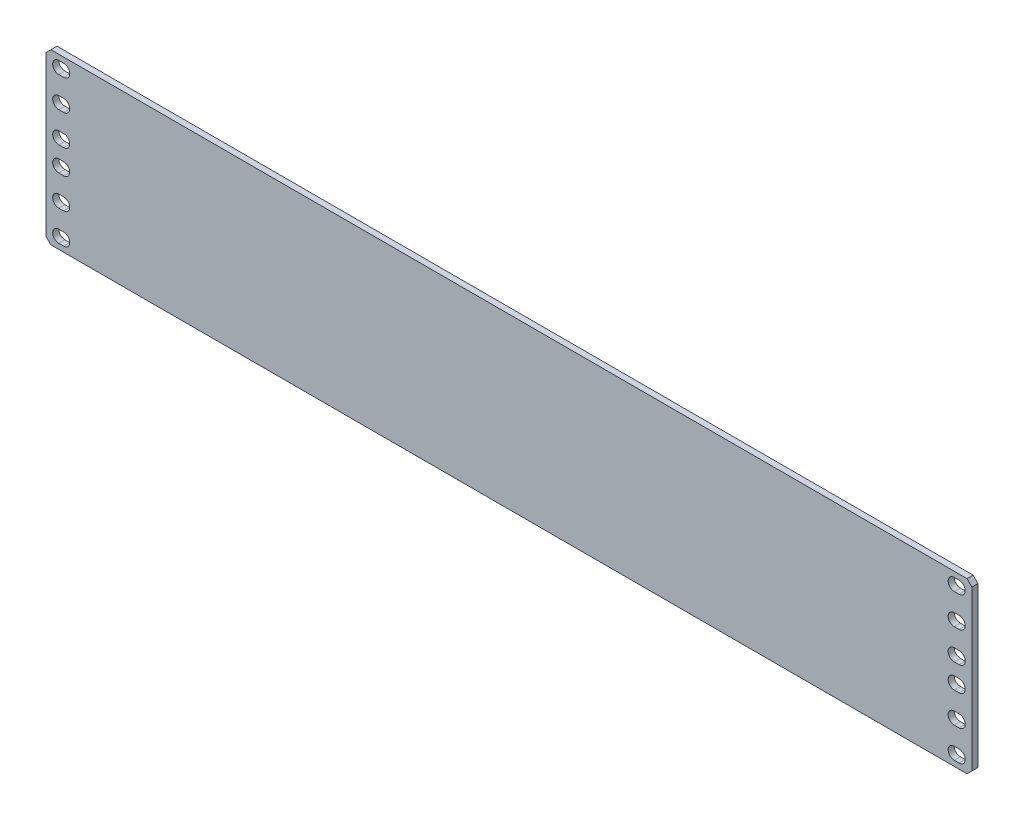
ISO-10303-21;
HEADER;
FILE_DESCRIPTION(('STEP AP214'),'2;1');
FILE_NAME('part.step','',(''),(''),'','','');
FILE_SCHEMA(('AUTOMOTIVE_DESIGN { 1 0 10303 214 1 1 1 1 }'));
ENDSEC;
DATA;
#1=APPLICATION_CONTEXT('core data for automotive mechanical design processes');
#2=APPLICATION_PROTOCOL_DEFINITION('international standard','automotive_design',2000,#1);
#3=PRODUCT_CONTEXT('',#1,'mechanical');
#4=PRODUCT('Part','Part','',(#3));
#5=PRODUCT_RELATED_PRODUCT_CATEGORY('part','',(#4));
#6=PRODUCT_DEFINITION_FORMATION('','',#4);
#7=PRODUCT_DEFINITION_CONTEXT('part definition',#1,'design');
#8=PRODUCT_DEFINITION('design','',#6,#7);
#9=PRODUCT_DEFINITION_SHAPE('','',#8);
#10=(LENGTH_UNIT() NAMED_UNIT(*) SI_UNIT(.MILLI.,.METRE.));
#11=(NAMED_UNIT(*) PLANE_ANGLE_UNIT() SI_UNIT($,.RADIAN.));
#12=(NAMED_UNIT(*) SI_UNIT($,.STERADIAN.) SOLID_ANGLE_UNIT());
#13=UNCERTAINTY_MEASURE_WITH_UNIT(LENGTH_MEASURE(1.E-05),#10,'distance_accuracy_value','');
#14=(GEOMETRIC_REPRESENTATION_CONTEXT(3) GLOBAL_UNCERTAINTY_ASSIGNED_CONTEXT((#13)) GLOBAL_UNIT_ASSIGNED_CONTEXT((#10,
#11,#12)) REPRESENTATION_CONTEXT('',''));
#15=CARTESIAN_POINT('',(0.,0.,0.));
#16=DIRECTION('',(0.,0.,1.));
#17=DIRECTION('',(1.,0.,0.));
#18=AXIS2_PLACEMENT_3D('',#15,#16,#17);
#19=CARTESIAN_POINT('',(241.3,-44.053125,3.175));
#20=DIRECTION('',(1.,0.,0.));
#21=DIRECTION('',(0.,0.,-1.));
#22=AXIS2_PLACEMENT_3D('',#19,#20,#21);
#23=PLANE('',#22);
#24=DIRECTION('',(0.,-1.,0.));
#25=VECTOR('',#24,1.);
#26=CARTESIAN_POINT('',(241.3,-44.053125,3.175));
#27=LINE('',#26,#25);
#28=CARTESIAN_POINT('',(241.3,41.5131249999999,3.175));
#29=VERTEX_POINT('',#28);
#30=CARTESIAN_POINT('',(241.3,-41.513125,3.175));
#31=VERTEX_POINT('',#30);
#32=EDGE_CURVE('E772',#29,#31,#27,.T.);
#33=ORIENTED_EDGE('',*,*,#32,.T.);
#34=DIRECTION('',(0.,0.,-1.));
#35=VECTOR('',#34,1.);
#36=CARTESIAN_POINT('',(241.3,-41.513125,3.175));
#37=LINE('',#36,#35);
#38=CARTESIAN_POINT('',(241.3,-41.513125,0.));
#39=VERTEX_POINT('',#38);
#40=EDGE_CURVE('E797',#31,#39,#37,.T.);
#41=ORIENTED_EDGE('',*,*,#40,.T.);
#42=DIRECTION('',(0.,-1.,0.));
#43=VECTOR('',#42,1.);
#44=CARTESIAN_POINT('',(241.3,-44.053125,0.));
#45=LINE('',#44,#43);
#46=CARTESIAN_POINT('',(241.3,41.5131249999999,0.));
#47=VERTEX_POINT('',#46);
#48=EDGE_CURVE('E771',#47,#39,#45,.T.);
#49=ORIENTED_EDGE('',*,*,#48,.F.);
#50=DIRECTION('',(0.,0.,1.));
#51=VECTOR('',#50,1.);
#52=CARTESIAN_POINT('',(241.3,41.5131249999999,3.175));
#53=LINE('',#52,#51);
#54=EDGE_CURVE('E785',#47,#29,#53,.T.);
#55=ORIENTED_EDGE('',*,*,#54,.T.);
#56=EDGE_LOOP('',(#33,#41,#49,#55));
#57=FACE_BOUND('',#56,.T.);
#58=ADVANCED_FACE('F33',(#57),#23,.T.);
#59=CARTESIAN_POINT('',(-241.3,44.053125,3.175));
#60=DIRECTION('',(0.,1.,0.));
#61=DIRECTION('',(0.,0.,1.));
#62=AXIS2_PLACEMENT_3D('',#59,#60,#61);
#63=PLANE('',#62);
#64=DIRECTION('',(1.,0.,0.));
#65=VECTOR('',#64,1.);
#66=CARTESIAN_POINT('',(-241.3,44.053125,3.175));
#67=LINE('',#66,#65);
#68=CARTESIAN_POINT('',(-238.76,44.053125,3.175));
#69=VERTEX_POINT('',#68);
#70=CARTESIAN_POINT('',(238.76,44.053125,3.175));
#71=VERTEX_POINT('',#70);
#72=EDGE_CURVE('E782',#69,#71,#67,.T.);
#73=ORIENTED_EDGE('',*,*,#72,.T.);
#74=DIRECTION('',(0.,0.,-1.));
#75=VECTOR('',#74,1.);
#76=CARTESIAN_POINT('',(238.76,44.053125,3.175));
#77=LINE('',#76,#75);
#78=CARTESIAN_POINT('',(238.76,44.053125,0.));
#79=VERTEX_POINT('',#78);
#80=EDGE_CURVE('E823',#71,#79,#77,.T.);
#81=ORIENTED_EDGE('',*,*,#80,.T.);
#82=DIRECTION('',(1.,0.,0.));
#83=VECTOR('',#82,1.);
#84=CARTESIAN_POINT('',(-241.3,44.053125,0.));
#85=LINE('',#84,#83);
#86=CARTESIAN_POINT('',(-238.76,44.053125,0.));
#87=VERTEX_POINT('',#86);
#88=EDGE_CURVE('E776',#87,#79,#85,.T.);
#89=ORIENTED_EDGE('',*,*,#88,.F.);
#90=DIRECTION('',(0.,0.,1.));
#91=VECTOR('',#90,1.);
#92=CARTESIAN_POINT('',(-238.76,44.053125,3.175));
#93=LINE('',#92,#91);
#94=EDGE_CURVE('E821',#87,#69,#93,.T.);
#95=ORIENTED_EDGE('',*,*,#94,.T.);
#96=EDGE_LOOP('',(#73,#81,#89,#95));
#97=FACE_BOUND('',#96,.T.);
#98=ADVANCED_FACE('F860',(#97),#63,.T.);
#99=CARTESIAN_POINT('',(-241.3,-44.053125,3.175));
#100=DIRECTION('',(-1.,0.,0.));
#101=DIRECTION('',(0.,0.,1.));
#102=AXIS2_PLACEMENT_3D('',#99,#100,#101);
#103=PLANE('',#102);
#104=DIRECTION('',(0.,1.,0.));
#105=VECTOR('',#104,1.);
#106=CARTESIAN_POINT('',(-241.3,-44.053125,0.));
#107=LINE('',#106,#105);
#108=CARTESIAN_POINT('',(-241.3,-41.5131249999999,0.));
#109=VERTEX_POINT('',#108);
#110=CARTESIAN_POINT('',(-241.3,41.513125,0.));
#111=VERTEX_POINT('',#110);
#112=EDGE_CURVE('E791',#109,#111,#107,.T.);
#113=ORIENTED_EDGE('',*,*,#112,.F.);
#114=DIRECTION('',(0.,0.,1.));
#115=VECTOR('',#114,1.);
#116=CARTESIAN_POINT('',(-241.3,-41.5131249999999,3.175));
#117=LINE('',#116,#115);
#118=CARTESIAN_POINT('',(-241.3,-41.5131249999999,3.175));
#119=VERTEX_POINT('',#118);
#120=EDGE_CURVE('E11',#109,#119,#117,.T.);
#121=ORIENTED_EDGE('',*,*,#120,.T.);
#122=DIRECTION('',(0.,1.,0.));
#123=VECTOR('',#122,1.);
#124=CARTESIAN_POINT('',(-241.3,-44.053125,3.175));
#125=LINE('',#124,#123);
#126=CARTESIAN_POINT('',(-241.3,41.513125,3.175));
#127=VERTEX_POINT('',#126);
#128=EDGE_CURVE('E779',#119,#127,#125,.T.);
#129=ORIENTED_EDGE('',*,*,#128,.T.);
#130=DIRECTION('',(0.,0.,-1.));
#131=VECTOR('',#130,1.);
#132=CARTESIAN_POINT('',(-241.3,41.513125,3.175));
#133=LINE('',#132,#131);
#134=EDGE_CURVE('E41',#127,#111,#133,.T.);
#135=ORIENTED_EDGE('',*,*,#134,.T.);
#136=EDGE_LOOP('',(#113,#121,#129,#135));
#137=FACE_BOUND('',#136,.T.);
#138=ADVANCED_FACE('F829',(#137),#103,.T.);
#139=CARTESIAN_POINT('',(-241.3,-44.053125,3.175));
#140=DIRECTION('',(0.,-1.,0.));
#141=DIRECTION('',(0.,0.,-1.));
#142=AXIS2_PLACEMENT_3D('',#139,#140,#141);
#143=PLANE('',#142);
#144=DIRECTION('',(-1.,0.,0.));
#145=VECTOR('',#144,1.);
#146=CARTESIAN_POINT('',(-241.3,-44.053125,0.));
#147=LINE('',#146,#145);
#148=CARTESIAN_POINT('',(238.76,-44.053125,0.));
#149=VERTEX_POINT('',#148);
#150=CARTESIAN_POINT('',(-238.76,-44.053125,0.));
#151=VERTEX_POINT('',#150);
#152=EDGE_CURVE('E788',#149,#151,#147,.T.);
#153=ORIENTED_EDGE('',*,*,#152,.F.);
#154=DIRECTION('',(0.,0.,1.));
#155=VECTOR('',#154,1.);
#156=CARTESIAN_POINT('',(238.76,-44.053125,3.175));
#157=LINE('',#156,#155);
#158=CARTESIAN_POINT('',(238.76,-44.053125,3.175));
#159=VERTEX_POINT('',#158);
#160=EDGE_CURVE('E811',#149,#159,#157,.T.);
#161=ORIENTED_EDGE('',*,*,#160,.T.);
#162=DIRECTION('',(-1.,0.,0.));
#163=VECTOR('',#162,1.);
#164=CARTESIAN_POINT('',(-241.3,-44.053125,3.175));
#165=LINE('',#164,#163);
#166=CARTESIAN_POINT('',(-238.76,-44.053125,3.175));
#167=VERTEX_POINT('',#166);
#168=EDGE_CURVE('E775',#159,#167,#165,.T.);
#169=ORIENTED_EDGE('',*,*,#168,.T.);
#170=DIRECTION('',(0.,0.,-1.));
#171=VECTOR('',#170,1.);
#172=CARTESIAN_POINT('',(-238.76,-44.053125,3.175));
#173=LINE('',#172,#171);
#174=EDGE_CURVE('E808',#167,#151,#173,.T.);
#175=ORIENTED_EDGE('',*,*,#174,.T.);
#176=EDGE_LOOP('',(#153,#161,#169,#175));
#177=FACE_BOUND('',#176,.T.);
#178=ADVANCED_FACE('F842',(#177),#143,.T.);
#179=CARTESIAN_POINT('',(0.,0.,3.175));
#180=DIRECTION('',(0.,0.,-1.));
#181=DIRECTION('',(-1.,0.,0.));
#182=AXIS2_PLACEMENT_3D('',#179,#180,#181);
#183=PLANE('',#182);
#184=DIRECTION('',(1.,0.,0.));
#185=VECTOR('',#184,1.);
#186=CARTESIAN_POINT('',(232.0925,19.05,3.175));
#187=LINE('',#186,#185);
#188=CARTESIAN_POINT('',(232.0925,19.05,3.175));
#189=VERTEX_POINT('',#188);
#190=CARTESIAN_POINT('',(234.6325,19.05,3.175));
#191=VERTEX_POINT('',#190);
#192=EDGE_CURVE('E404',#189,#191,#187,.T.);
#193=ORIENTED_EDGE('',*,*,#192,.F.);
#194=CARTESIAN_POINT('',(232.0925,22.225,3.175));
#195=DIRECTION('',(0.,0.,1.));
#196=DIRECTION('',(1.,0.,0.));
#197=AXIS2_PLACEMENT_3D('',#194,#195,#196);
#198=CIRCLE('',#197,3.17499999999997);
#199=CARTESIAN_POINT('',(232.0925,25.4,3.175));
#200=VERTEX_POINT('',#199);
#201=EDGE_CURVE('E48',#200,#189,#198,.T.);
#202=ORIENTED_EDGE('',*,*,#201,.F.);
#203=DIRECTION('',(-1.,0.,0.));
#204=VECTOR('',#203,1.);
#205=CARTESIAN_POINT('',(232.0925,25.4,3.175));
#206=LINE('',#205,#204);
#207=CARTESIAN_POINT('',(234.6325,25.4,3.175));
#208=VERTEX_POINT('',#207);
#209=EDGE_CURVE('E397',#208,#200,#206,.T.);
#210=ORIENTED_EDGE('',*,*,#209,.F.);
#211=CARTESIAN_POINT('',(234.6325,22.225,3.175));
#212=DIRECTION('',(0.,0.,1.));
#213=DIRECTION('',(1.,0.,0.));
#214=AXIS2_PLACEMENT_3D('',#211,#212,#213);
#215=CIRCLE('',#214,3.17499999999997);
#216=EDGE_CURVE('E411',#191,#208,#215,.T.);
#217=ORIENTED_EDGE('',*,*,#216,.F.);
#218=EDGE_LOOP('',(#193,#202,#210,#217));
#219=FACE_BOUND('',#218,.T.);
#220=DIRECTION('',(1.,0.,0.));
#221=VECTOR('',#220,1.);
#222=CARTESIAN_POINT('',(-234.6325,19.05,3.175));
#223=LINE('',#222,#221);
#224=CARTESIAN_POINT('',(-234.6325,19.05,3.175));
#225=VERTEX_POINT('',#224);
#226=CARTESIAN_POINT('',(-232.0925,19.05,3.175));
#227=VERTEX_POINT('',#226);
#228=EDGE_CURVE('E430',#225,#227,#223,.T.);
#229=ORIENTED_EDGE('',*,*,#228,.F.);
#230=CARTESIAN_POINT('',(-234.6325,22.225,3.175));
#231=DIRECTION('',(0.,0.,1.));
#232=DIRECTION('',(1.,0.,0.));
#233=AXIS2_PLACEMENT_3D('',#230,#231,#232);
#234=CIRCLE('',#233,3.175);
#235=CARTESIAN_POINT('',(-234.6325,25.4,3.175));
#236=VERTEX_POINT('',#235);
#237=EDGE_CURVE('E428',#236,#225,#234,.T.);
#238=ORIENTED_EDGE('',*,*,#237,.F.);
#239=DIRECTION('',(-1.,0.,0.));
#240=VECTOR('',#239,1.);
#241=CARTESIAN_POINT('',(-234.6325,25.4,3.175));
#242=LINE('',#241,#240);
#243=CARTESIAN_POINT('',(-232.0925,25.4,3.175));
#244=VERTEX_POINT('',#243);
#245=EDGE_CURVE('E436',#244,#236,#242,.T.);
#246=ORIENTED_EDGE('',*,*,#245,.F.);
#247=CARTESIAN_POINT('',(-232.0925,22.225,3.175));
#248=DIRECTION('',(0.,0.,1.));
#249=DIRECTION('',(1.,0.,0.));
#250=AXIS2_PLACEMENT_3D('',#247,#248,#249);
#251=CIRCLE('',#250,3.175);
#252=EDGE_CURVE('E433',#227,#244,#251,.T.);
#253=ORIENTED_EDGE('',*,*,#252,.F.);
#254=EDGE_LOOP('',(#229,#238,#246,#253));
#255=FACE_BOUND('',#254,.T.);
#256=DIRECTION('',(1.,0.,0.));
#257=VECTOR('',#256,1.);
#258=CARTESIAN_POINT('',(232.0925,3.17499999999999,3.175));
#259=LINE('',#258,#257);
#260=CARTESIAN_POINT('',(232.0925,3.17499999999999,3.175));
#261=VERTEX_POINT('',#260);
#262=CARTESIAN_POINT('',(234.6325,3.17499999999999,3.175));
#263=VERTEX_POINT('',#262);
#264=EDGE_CURVE('E462',#261,#263,#259,.T.);
#265=ORIENTED_EDGE('',*,*,#264,.F.);
#266=CARTESIAN_POINT('',(232.0925,6.34999999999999,3.175));
#267=DIRECTION('',(0.,0.,1.));
#268=DIRECTION('',(1.,0.,0.));
#269=AXIS2_PLACEMENT_3D('',#266,#267,#268);
#270=CIRCLE('',#269,3.175);
#271=CARTESIAN_POINT('',(232.0925,9.52499999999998,3.175));
#272=VERTEX_POINT('',#271);
#273=EDGE_CURVE('E460',#272,#261,#270,.T.);
#274=ORIENTED_EDGE('',*,*,#273,.F.);
#275=DIRECTION('',(-1.,0.,0.));
#276=VECTOR('',#275,1.);
#277=CARTESIAN_POINT('',(232.0925,9.52499999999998,3.175));
#278=LINE('',#277,#276);
#279=CARTESIAN_POINT('',(234.6325,9.52499999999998,3.175));
#280=VERTEX_POINT('',#279);
#281=EDGE_CURVE('E468',#280,#272,#278,.T.);
#282=ORIENTED_EDGE('',*,*,#281,.F.);
#283=CARTESIAN_POINT('',(234.6325,6.34999999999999,3.175));
#284=DIRECTION('',(0.,0.,1.));
#285=DIRECTION('',(1.,0.,0.));
#286=AXIS2_PLACEMENT_3D('',#283,#284,#285);
#287=CIRCLE('',#286,3.175);
#288=EDGE_CURVE('E465',#263,#280,#287,.T.);
#289=ORIENTED_EDGE('',*,*,#288,.F.);
#290=EDGE_LOOP('',(#265,#274,#282,#289));
#291=FACE_BOUND('',#290,.T.);
#292=DIRECTION('',(1.,0.,0.));
#293=VECTOR('',#292,1.);
#294=CARTESIAN_POINT('',(232.0925,34.925,3.175));
#295=LINE('',#294,#293);
#296=CARTESIAN_POINT('',(232.0925,34.925,3.175));
#297=VERTEX_POINT('',#296);
#298=CARTESIAN_POINT('',(234.6325,34.925,3.175));
#299=VERTEX_POINT('',#298);
#300=EDGE_CURVE('E494',#297,#299,#295,.T.);
#301=ORIENTED_EDGE('',*,*,#300,.F.);
#302=CARTESIAN_POINT('',(232.0925,38.1,3.175));
#303=DIRECTION('',(0.,0.,1.));
#304=DIRECTION('',(1.,0.,0.));
#305=AXIS2_PLACEMENT_3D('',#302,#303,#304);
#306=CIRCLE('',#305,3.175);
#307=CARTESIAN_POINT('',(232.0925,41.275,3.175));
#308=VERTEX_POINT('',#307);
#309=EDGE_CURVE('E492',#308,#297,#306,.T.);
#310=ORIENTED_EDGE('',*,*,#309,.F.);
#311=DIRECTION('',(-1.,0.,0.));
#312=VECTOR('',#311,1.);
#313=CARTESIAN_POINT('',(232.0925,41.275,3.175));
#314=LINE('',#313,#312);
#315=CARTESIAN_POINT('',(234.6325,41.275,3.175));
#316=VERTEX_POINT('',#315);
#317=EDGE_CURVE('E500',#316,#308,#314,.T.);
#318=ORIENTED_EDGE('',*,*,#317,.F.);
#319=CARTESIAN_POINT('',(234.6325,38.1,3.175));
#320=DIRECTION('',(0.,0.,1.));
#321=DIRECTION('',(1.,0.,0.));
#322=AXIS2_PLACEMENT_3D('',#319,#320,#321);
#323=CIRCLE('',#322,3.175);
#324=EDGE_CURVE('E497',#299,#316,#323,.T.);
#325=ORIENTED_EDGE('',*,*,#324,.F.);
#326=EDGE_LOOP('',(#301,#310,#318,#325));
#327=FACE_BOUND('',#326,.T.);
#328=DIRECTION('',(1.,0.,0.));
#329=VECTOR('',#328,1.);
#330=CARTESIAN_POINT('',(-234.6325,3.17499999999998,3.175));
#331=LINE('',#330,#329);
#332=CARTESIAN_POINT('',(-234.6325,3.17499999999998,3.175));
#333=VERTEX_POINT('',#332);
#334=CARTESIAN_POINT('',(-232.0925,3.17499999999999,3.175));
#335=VERTEX_POINT('',#334);
#336=EDGE_CURVE('E526',#333,#335,#331,.T.);
#337=ORIENTED_EDGE('',*,*,#336,.F.);
#338=CARTESIAN_POINT('',(-234.6325,6.34999999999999,3.175));
#339=DIRECTION('',(0.,0.,1.));
#340=DIRECTION('',(1.,0.,0.));
#341=AXIS2_PLACEMENT_3D('',#338,#339,#340);
#342=CIRCLE('',#341,3.175);
#343=CARTESIAN_POINT('',(-234.6325,9.52499999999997,3.175));
#344=VERTEX_POINT('',#343);
#345=EDGE_CURVE('E524',#344,#333,#342,.T.);
#346=ORIENTED_EDGE('',*,*,#345,.F.);
#347=DIRECTION('',(-1.,0.,0.));
#348=VECTOR('',#347,1.);
#349=CARTESIAN_POINT('',(-234.6325,9.52499999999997,3.175));
#350=LINE('',#349,#348);
#351=CARTESIAN_POINT('',(-232.0925,9.52499999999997,3.175));
#352=VERTEX_POINT('',#351);
#353=EDGE_CURVE('E532',#352,#344,#350,.T.);
#354=ORIENTED_EDGE('',*,*,#353,.F.);
#355=CARTESIAN_POINT('',(-232.0925,6.34999999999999,3.175));
#356=DIRECTION('',(0.,0.,1.));
#357=DIRECTION('',(1.,0.,0.));
#358=AXIS2_PLACEMENT_3D('',#355,#356,#357);
#359=CIRCLE('',#358,3.175);
#360=EDGE_CURVE('E529',#335,#352,#359,.T.);
#361=ORIENTED_EDGE('',*,*,#360,.F.);
#362=EDGE_LOOP('',(#337,#346,#354,#361));
#363=FACE_BOUND('',#362,.T.);
#364=DIRECTION('',(1.,0.,0.));
#365=VECTOR('',#364,1.);
#366=CARTESIAN_POINT('',(-234.6325,34.925,3.175));
#367=LINE('',#366,#365);
#368=CARTESIAN_POINT('',(-234.6325,34.925,3.175));
#369=VERTEX_POINT('',#368);
#370=CARTESIAN_POINT('',(-232.0925,34.925,3.175));
#371=VERTEX_POINT('',#370);
#372=EDGE_CURVE('E558',#369,#371,#367,.T.);
#373=ORIENTED_EDGE('',*,*,#372,.F.);
#374=CARTESIAN_POINT('',(-234.6325,38.1,3.175));
#375=DIRECTION('',(0.,0.,1.));
#376=DIRECTION('',(1.,0.,0.));
#377=AXIS2_PLACEMENT_3D('',#374,#375,#376);
#378=CIRCLE('',#377,3.175);
#379=CARTESIAN_POINT('',(-234.6325,41.275,3.175));
#380=VERTEX_POINT('',#379);
#381=EDGE_CURVE('E556',#380,#369,#378,.T.);
#382=ORIENTED_EDGE('',*,*,#381,.F.);
#383=DIRECTION('',(-1.,0.,0.));
#384=VECTOR('',#383,1.);
#385=CARTESIAN_POINT('',(-234.6325,41.275,3.175));
#386=LINE('',#385,#384);
#387=CARTESIAN_POINT('',(-232.0925,41.275,3.175));
#388=VERTEX_POINT('',#387);
#389=EDGE_CURVE('E564',#388,#380,#386,.T.);
#390=ORIENTED_EDGE('',*,*,#389,.F.);
#391=CARTESIAN_POINT('',(-232.0925,38.1,3.175));
#392=DIRECTION('',(0.,0.,1.));
#393=DIRECTION('',(1.,0.,0.));
#394=AXIS2_PLACEMENT_3D('',#391,#392,#393);
#395=CIRCLE('',#394,3.175);
#396=EDGE_CURVE('E561',#371,#388,#395,.T.);
#397=ORIENTED_EDGE('',*,*,#396,.F.);
#398=EDGE_LOOP('',(#373,#382,#390,#397));
#399=FACE_BOUND('',#398,.T.);
#400=DIRECTION('',(1.,0.,0.));
#401=VECTOR('',#400,1.);
#402=CARTESIAN_POINT('',(232.0925,-25.4,3.175));
#403=LINE('',#402,#401);
#404=CARTESIAN_POINT('',(232.0925,-25.4,3.175));
#405=VERTEX_POINT('',#404);
#406=CARTESIAN_POINT('',(234.6325,-25.4,3.175));
#407=VERTEX_POINT('',#406);
#408=EDGE_CURVE('E590',#405,#407,#403,.T.);
#409=ORIENTED_EDGE('',*,*,#408,.F.);
#410=CARTESIAN_POINT('',(232.0925,-22.225,3.175));
#411=DIRECTION('',(0.,0.,1.));
#412=DIRECTION('',(1.,0.,0.));
#413=AXIS2_PLACEMENT_3D('',#410,#411,#412);
#414=CIRCLE('',#413,3.17499999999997);
#415=CARTESIAN_POINT('',(232.0925,-19.05,3.175));
#416=VERTEX_POINT('',#415);
#417=EDGE_CURVE('E588',#416,#405,#414,.T.);
#418=ORIENTED_EDGE('',*,*,#417,.F.);
#419=DIRECTION('',(-1.,0.,0.));
#420=VECTOR('',#419,1.);
#421=CARTESIAN_POINT('',(232.0925,-19.05,3.175));
#422=LINE('',#421,#420);
#423=CARTESIAN_POINT('',(234.6325,-19.05,3.175));
#424=VERTEX_POINT('',#423);
#425=EDGE_CURVE('E596',#424,#416,#422,.T.);
#426=ORIENTED_EDGE('',*,*,#425,.F.);
#427=CARTESIAN_POINT('',(234.6325,-22.225,3.175));
#428=DIRECTION('',(0.,0.,1.));
#429=DIRECTION('',(1.,0.,0.));
#430=AXIS2_PLACEMENT_3D('',#427,#428,#429);
#431=CIRCLE('',#430,3.17499999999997);
#432=EDGE_CURVE('E593',#407,#424,#431,.T.);
#433=ORIENTED_EDGE('',*,*,#432,.F.);
#434=EDGE_LOOP('',(#409,#418,#426,#433));
#435=FACE_BOUND('',#434,.T.);
#436=DIRECTION('',(1.,0.,0.));
#437=VECTOR('',#436,1.);
#438=CARTESIAN_POINT('',(-234.6325,-25.4,3.175));
#439=LINE('',#438,#437);
#440=CARTESIAN_POINT('',(-234.6325,-25.4,3.175));
#441=VERTEX_POINT('',#440);
#442=CARTESIAN_POINT('',(-232.0925,-25.4,3.175));
#443=VERTEX_POINT('',#442);
#444=EDGE_CURVE('E622',#441,#443,#439,.T.);
#445=ORIENTED_EDGE('',*,*,#444,.F.);
#446=CARTESIAN_POINT('',(-234.6325,-22.225,3.175));
#447=DIRECTION('',(0.,0.,1.));
#448=DIRECTION('',(1.,0.,0.));
#449=AXIS2_PLACEMENT_3D('',#446,#447,#448);
#450=CIRCLE('',#449,3.175);
#451=CARTESIAN_POINT('',(-234.6325,-19.05,3.175));
#452=VERTEX_POINT('',#451);
#453=EDGE_CURVE('E620',#452,#441,#450,.T.);
#454=ORIENTED_EDGE('',*,*,#453,.F.);
#455=DIRECTION('',(-1.,0.,0.));
#456=VECTOR('',#455,1.);
#457=CARTESIAN_POINT('',(-234.6325,-19.05,3.175));
#458=LINE('',#457,#456);
#459=CARTESIAN_POINT('',(-232.0925,-19.05,3.175));
#460=VERTEX_POINT('',#459);
#461=EDGE_CURVE('E628',#460,#452,#458,.T.);
#462=ORIENTED_EDGE('',*,*,#461,.F.);
#463=CARTESIAN_POINT('',(-232.0925,-22.225,3.175));
#464=DIRECTION('',(0.,0.,1.));
#465=DIRECTION('',(1.,0.,0.));
#466=AXIS2_PLACEMENT_3D('',#463,#464,#465);
#467=CIRCLE('',#466,3.175);
#468=EDGE_CURVE('E625',#443,#460,#467,.T.);
#469=ORIENTED_EDGE('',*,*,#468,.F.);
#470=EDGE_LOOP('',(#445,#454,#462,#469));
#471=FACE_BOUND('',#470,.T.);
#472=DIRECTION('',(1.,0.,0.));
#473=VECTOR('',#472,1.);
#474=CARTESIAN_POINT('',(232.0925,-41.275,3.175));
#475=LINE('',#474,#473);
#476=CARTESIAN_POINT('',(232.0925,-41.275,3.175));
#477=VERTEX_POINT('',#476);
#478=CARTESIAN_POINT('',(234.6325,-41.275,3.175));
#479=VERTEX_POINT('',#478);
#480=EDGE_CURVE('E654',#477,#479,#475,.T.);
#481=ORIENTED_EDGE('',*,*,#480,.F.);
#482=CARTESIAN_POINT('',(232.0925,-38.1,3.175));
#483=DIRECTION('',(0.,0.,1.));
#484=DIRECTION('',(1.,0.,0.));
#485=AXIS2_PLACEMENT_3D('',#482,#483,#484);
#486=CIRCLE('',#485,3.175);
#487=CARTESIAN_POINT('',(232.0925,-34.925,3.175));
#488=VERTEX_POINT('',#487);
#489=EDGE_CURVE('E652',#488,#477,#486,.T.);
#490=ORIENTED_EDGE('',*,*,#489,.F.);
#491=DIRECTION('',(-1.,0.,0.));
#492=VECTOR('',#491,1.);
#493=CARTESIAN_POINT('',(232.0925,-34.925,3.175));
#494=LINE('',#493,#492);
#495=CARTESIAN_POINT('',(234.6325,-34.925,3.175));
#496=VERTEX_POINT('',#495);
#497=EDGE_CURVE('E660',#496,#488,#494,.T.);
#498=ORIENTED_EDGE('',*,*,#497,.F.);
#499=CARTESIAN_POINT('',(234.6325,-38.1,3.175));
#500=DIRECTION('',(0.,0.,1.));
#501=DIRECTION('',(1.,0.,0.));
#502=AXIS2_PLACEMENT_3D('',#499,#500,#501);
#503=CIRCLE('',#502,3.175);
#504=EDGE_CURVE('E657',#479,#496,#503,.T.);
#505=ORIENTED_EDGE('',*,*,#504,.F.);
#506=EDGE_LOOP('',(#481,#490,#498,#505));
#507=FACE_BOUND('',#506,.T.);
#508=DIRECTION('',(1.,0.,0.));
#509=VECTOR('',#508,1.);
#510=CARTESIAN_POINT('',(232.0925,-9.52500000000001,3.175));
#511=LINE('',#510,#509);
#512=CARTESIAN_POINT('',(232.0925,-9.52500000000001,3.175));
#513=VERTEX_POINT('',#512);
#514=CARTESIAN_POINT('',(234.6325,-9.52500000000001,3.175));
#515=VERTEX_POINT('',#514);
#516=EDGE_CURVE('E686',#513,#515,#511,.T.);
#517=ORIENTED_EDGE('',*,*,#516,.F.);
#518=CARTESIAN_POINT('',(232.0925,-6.35000000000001,3.175));
#519=DIRECTION('',(0.,0.,1.));
#520=DIRECTION('',(1.,0.,0.));
#521=AXIS2_PLACEMENT_3D('',#518,#519,#520);
#522=CIRCLE('',#521,3.175);
#523=CARTESIAN_POINT('',(232.0925,-3.17500000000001,3.175));
#524=VERTEX_POINT('',#523);
#525=EDGE_CURVE('E684',#524,#513,#522,.T.);
#526=ORIENTED_EDGE('',*,*,#525,.F.);
#527=DIRECTION('',(-1.,0.,0.));
#528=VECTOR('',#527,1.);
#529=CARTESIAN_POINT('',(232.0925,-3.17500000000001,3.175));
#530=LINE('',#529,#528);
#531=CARTESIAN_POINT('',(234.6325,-3.17500000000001,3.175));
#532=VERTEX_POINT('',#531);
#533=EDGE_CURVE('E692',#532,#524,#530,.T.);
#534=ORIENTED_EDGE('',*,*,#533,.F.);
#535=CARTESIAN_POINT('',(234.6325,-6.35000000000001,3.175));
#536=DIRECTION('',(0.,0.,1.));
#537=DIRECTION('',(1.,0.,0.));
#538=AXIS2_PLACEMENT_3D('',#535,#536,#537);
#539=CIRCLE('',#538,3.175);
#540=EDGE_CURVE('E689',#515,#532,#539,.T.);
#541=ORIENTED_EDGE('',*,*,#540,.F.);
#542=EDGE_LOOP('',(#517,#526,#534,#541));
#543=FACE_BOUND('',#542,.T.);
#544=DIRECTION('',(1.,0.,0.));
#545=VECTOR('',#544,1.);
#546=CARTESIAN_POINT('',(-234.6325,-41.275,3.175));
#547=LINE('',#546,#545);
#548=CARTESIAN_POINT('',(-234.6325,-41.275,3.175));
#549=VERTEX_POINT('',#548);
#550=CARTESIAN_POINT('',(-232.0925,-41.275,3.175));
#551=VERTEX_POINT('',#550);
#552=EDGE_CURVE('E718',#549,#551,#547,.T.);
#553=ORIENTED_EDGE('',*,*,#552,.F.);
#554=CARTESIAN_POINT('',(-234.6325,-38.1,3.175));
#555=DIRECTION('',(0.,0.,1.));
#556=DIRECTION('',(1.,0.,0.));
#557=AXIS2_PLACEMENT_3D('',#554,#555,#556);
#558=CIRCLE('',#557,3.175);
#559=CARTESIAN_POINT('',(-234.6325,-34.925,3.175));
#560=VERTEX_POINT('',#559);
#561=EDGE_CURVE('E716',#560,#549,#558,.T.);
#562=ORIENTED_EDGE('',*,*,#561,.F.);
#563=DIRECTION('',(-1.,0.,0.));
#564=VECTOR('',#563,1.);
#565=CARTESIAN_POINT('',(-234.6325,-34.925,3.175));
#566=LINE('',#565,#564);
#567=CARTESIAN_POINT('',(-232.0925,-34.925,3.175));
#568=VERTEX_POINT('',#567);
#569=EDGE_CURVE('E724',#568,#560,#566,.T.);
#570=ORIENTED_EDGE('',*,*,#569,.F.);
#571=CARTESIAN_POINT('',(-232.0925,-38.1,3.175));
#572=DIRECTION('',(0.,0.,1.));
#573=DIRECTION('',(1.,0.,0.));
#574=AXIS2_PLACEMENT_3D('',#571,#572,#573);
#575=CIRCLE('',#574,3.175);
#576=EDGE_CURVE('E721',#551,#568,#575,.T.);
#577=ORIENTED_EDGE('',*,*,#576,.F.);
#578=EDGE_LOOP('',(#553,#562,#570,#577));
#579=FACE_BOUND('',#578,.T.);
#580=DIRECTION('',(1.,0.,0.));
#581=VECTOR('',#580,1.);
#582=CARTESIAN_POINT('',(-234.6325,-9.52500000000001,3.175));
#583=LINE('',#582,#581);
#584=CARTESIAN_POINT('',(-234.6325,-9.52500000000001,3.175));
#585=VERTEX_POINT('',#584);
#586=CARTESIAN_POINT('',(-232.0925,-9.52500000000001,3.175));
#587=VERTEX_POINT('',#586);
#588=EDGE_CURVE('E750',#585,#587,#583,.T.);
#589=ORIENTED_EDGE('',*,*,#588,.F.);
#590=CARTESIAN_POINT('',(-234.6325,-6.35000000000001,3.175));
#591=DIRECTION('',(0.,0.,1.));
#592=DIRECTION('',(1.,0.,0.));
#593=AXIS2_PLACEMENT_3D('',#590,#591,#592);
#594=CIRCLE('',#593,3.175);
#595=CARTESIAN_POINT('',(-234.6325,-3.17500000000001,3.175));
#596=VERTEX_POINT('',#595);
#597=EDGE_CURVE('E748',#596,#585,#594,.T.);
#598=ORIENTED_EDGE('',*,*,#597,.F.);
#599=DIRECTION('',(-1.,0.,0.));
#600=VECTOR('',#599,1.);
#601=CARTESIAN_POINT('',(-234.6325,-3.17500000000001,3.175));
#602=LINE('',#601,#600);
#603=CARTESIAN_POINT('',(-232.0925,-3.17500000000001,3.175));
#604=VERTEX_POINT('',#603);
#605=EDGE_CURVE('E756',#604,#596,#602,.T.);
#606=ORIENTED_EDGE('',*,*,#605,.F.);
#607=CARTESIAN_POINT('',(-232.0925,-6.35000000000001,3.175));
#608=DIRECTION('',(0.,0.,1.));
#609=DIRECTION('',(1.,0.,0.));
#610=AXIS2_PLACEMENT_3D('',#607,#608,#609);
#611=CIRCLE('',#610,3.175);
#612=EDGE_CURVE('E753',#587,#604,#611,.T.);
#613=ORIENTED_EDGE('',*,*,#612,.F.);
#614=EDGE_LOOP('',(#589,#598,#606,#613));
#615=FACE_BOUND('',#614,.T.);
#616=ORIENTED_EDGE('',*,*,#168,.F.);
#617=DIRECTION('',(-0.707106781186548,-0.707106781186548,0.));
#618=VECTOR('',#617,1.);
#619=CARTESIAN_POINT('',(241.3,-41.513125,3.175));
#620=LINE('',#619,#618);
#621=EDGE_CURVE('E819',#159,#31,#620,.F.);
#622=ORIENTED_EDGE('',*,*,#621,.T.);
#623=ORIENTED_EDGE('',*,*,#32,.F.);
#624=DIRECTION('',(0.707106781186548,-0.707106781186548,0.));
#625=VECTOR('',#624,1.);
#626=CARTESIAN_POINT('',(238.76,44.053125,3.175));
#627=LINE('',#626,#625);
#628=EDGE_CURVE('E817',#29,#71,#627,.F.);
#629=ORIENTED_EDGE('',*,*,#628,.T.);
#630=ORIENTED_EDGE('',*,*,#72,.F.);
#631=DIRECTION('',(0.707106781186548,0.707106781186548,0.));
#632=VECTOR('',#631,1.);
#633=CARTESIAN_POINT('',(-241.3,41.513125,3.175));
#634=LINE('',#633,#632);
#635=EDGE_CURVE('E813',#69,#127,#634,.F.);
#636=ORIENTED_EDGE('',*,*,#635,.T.);
#637=ORIENTED_EDGE('',*,*,#128,.F.);
#638=DIRECTION('',(-0.707106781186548,0.707106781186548,0.));
#639=VECTOR('',#638,1.);
#640=CARTESIAN_POINT('',(-238.76,-44.053125,3.175));
#641=LINE('',#640,#639);
#642=EDGE_CURVE('E815',#119,#167,#641,.F.);
#643=ORIENTED_EDGE('',*,*,#642,.T.);
#644=EDGE_LOOP('',(#616,#622,#623,#629,#630,#636,#637,#643));
#645=FACE_BOUND('',#644,.T.);
#646=ADVANCED_FACE('F847',(#219,#255,#291,#327,#363,#399,#435,#471,#507,#543,#579,#615,#645),
#183,.F.);
#647=CARTESIAN_POINT('',(0.,0.,0.));
#648=DIRECTION('',(0.,0.,-1.));
#649=DIRECTION('',(-1.,0.,0.));
#650=AXIS2_PLACEMENT_3D('',#647,#648,#649);
#651=PLANE('',#650);
#652=CARTESIAN_POINT('',(232.0925,22.225,0.));
#653=DIRECTION('',(0.,0.,-1.));
#654=DIRECTION('',(-1.,0.,0.));
#655=AXIS2_PLACEMENT_3D('',#652,#653,#654);
#656=CIRCLE('',#655,3.17499999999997);
#657=CARTESIAN_POINT('',(232.0925,25.4,0.));
#658=VERTEX_POINT('',#657);
#659=CARTESIAN_POINT('',(232.0925,19.05,0.));
#660=VERTEX_POINT('',#659);
#661=EDGE_CURVE('E395',#658,#660,#656,.F.);
#662=ORIENTED_EDGE('',*,*,#661,.T.);
#663=DIRECTION('',(1.,0.,0.));
#664=VECTOR('',#663,1.);
#665=CARTESIAN_POINT('',(232.0925,19.05,0.));
#666=LINE('',#665,#664);
#667=CARTESIAN_POINT('',(234.6325,19.05,0.));
#668=VERTEX_POINT('',#667);
#669=EDGE_CURVE('E384',#660,#668,#666,.T.);
#670=ORIENTED_EDGE('',*,*,#669,.T.);
#671=CARTESIAN_POINT('',(234.6325,22.225,0.));
#672=DIRECTION('',(0.,0.,-1.));
#673=DIRECTION('',(-1.,0.,0.));
#674=AXIS2_PLACEMENT_3D('',#671,#672,#673);
#675=CIRCLE('',#674,3.17499999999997);
#676=CARTESIAN_POINT('',(234.6325,25.3999999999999,0.));
#677=VERTEX_POINT('',#676);
#678=EDGE_CURVE('E406',#668,#677,#675,.F.);
#679=ORIENTED_EDGE('',*,*,#678,.T.);
#680=DIRECTION('',(-1.,0.,0.));
#681=VECTOR('',#680,1.);
#682=CARTESIAN_POINT('',(232.0925,25.4,0.));
#683=LINE('',#682,#681);
#684=EDGE_CURVE('E402',#677,#658,#683,.T.);
#685=ORIENTED_EDGE('',*,*,#684,.T.);
#686=EDGE_LOOP('',(#662,#670,#679,#685));
#687=FACE_BOUND('',#686,.T.);
#688=CARTESIAN_POINT('',(-234.6325,22.225,0.));
#689=DIRECTION('',(0.,0.,-1.));
#690=DIRECTION('',(-1.,0.,0.));
#691=AXIS2_PLACEMENT_3D('',#688,#689,#690);
#692=CIRCLE('',#691,3.175);
#693=CARTESIAN_POINT('',(-234.6325,25.4,0.));
#694=VERTEX_POINT('',#693);
#695=CARTESIAN_POINT('',(-234.6325,19.05,0.));
#696=VERTEX_POINT('',#695);
#697=EDGE_CURVE('E425',#694,#696,#692,.F.);
#698=ORIENTED_EDGE('',*,*,#697,.T.);
#699=DIRECTION('',(1.,0.,0.));
#700=VECTOR('',#699,1.);
#701=CARTESIAN_POINT('',(-234.6325,19.05,0.));
#702=LINE('',#701,#700);
#703=CARTESIAN_POINT('',(-232.0925,19.05,0.));
#704=VERTEX_POINT('',#703);
#705=EDGE_CURVE('E442',#696,#704,#702,.T.);
#706=ORIENTED_EDGE('',*,*,#705,.T.);
#707=CARTESIAN_POINT('',(-232.0925,22.225,0.));
#708=DIRECTION('',(0.,0.,-1.));
#709=DIRECTION('',(-1.,0.,0.));
#710=AXIS2_PLACEMENT_3D('',#707,#708,#709);
#711=CIRCLE('',#710,3.175);
#712=CARTESIAN_POINT('',(-232.0925,25.4,0.));
#713=VERTEX_POINT('',#712);
#714=EDGE_CURVE('E391',#704,#713,#711,.F.);
#715=ORIENTED_EDGE('',*,*,#714,.T.);
#716=DIRECTION('',(-1.,0.,0.));
#717=VECTOR('',#716,1.);
#718=CARTESIAN_POINT('',(-234.6325,25.4,0.));
#719=LINE('',#718,#717);
#720=EDGE_CURVE('E422',#713,#694,#719,.T.);
#721=ORIENTED_EDGE('',*,*,#720,.T.);
#722=EDGE_LOOP('',(#698,#706,#715,#721));
#723=FACE_BOUND('',#722,.T.);
#724=CARTESIAN_POINT('',(232.0925,6.34999999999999,0.));
#725=DIRECTION('',(0.,0.,-1.));
#726=DIRECTION('',(-1.,0.,0.));
#727=AXIS2_PLACEMENT_3D('',#724,#725,#726);
#728=CIRCLE('',#727,3.175);
#729=CARTESIAN_POINT('',(232.0925,9.52499999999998,0.));
#730=VERTEX_POINT('',#729);
#731=CARTESIAN_POINT('',(232.0925,3.17499999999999,0.));
#732=VERTEX_POINT('',#731);
#733=EDGE_CURVE('E457',#730,#732,#728,.F.);
#734=ORIENTED_EDGE('',*,*,#733,.T.);
#735=DIRECTION('',(1.,0.,0.));
#736=VECTOR('',#735,1.);
#737=CARTESIAN_POINT('',(232.0925,3.17499999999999,0.));
#738=LINE('',#737,#736);
#739=CARTESIAN_POINT('',(234.6325,3.17499999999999,0.));
#740=VERTEX_POINT('',#739);
#741=EDGE_CURVE('E474',#732,#740,#738,.T.);
#742=ORIENTED_EDGE('',*,*,#741,.T.);
#743=CARTESIAN_POINT('',(234.6325,6.34999999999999,0.));
#744=DIRECTION('',(0.,0.,-1.));
#745=DIRECTION('',(-1.,0.,0.));
#746=AXIS2_PLACEMENT_3D('',#743,#744,#745);
#747=CIRCLE('',#746,3.175);
#748=CARTESIAN_POINT('',(234.6325,9.52499999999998,0.));
#749=VERTEX_POINT('',#748);
#750=EDGE_CURVE('E451',#740,#749,#747,.F.);
#751=ORIENTED_EDGE('',*,*,#750,.T.);
#752=DIRECTION('',(-1.,0.,0.));
#753=VECTOR('',#752,1.);
#754=CARTESIAN_POINT('',(232.0925,9.52499999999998,0.));
#755=LINE('',#754,#753);
#756=EDGE_CURVE('E454',#749,#730,#755,.T.);
#757=ORIENTED_EDGE('',*,*,#756,.T.);
#758=EDGE_LOOP('',(#734,#742,#751,#757));
#759=FACE_BOUND('',#758,.T.);
#760=CARTESIAN_POINT('',(232.0925,38.1,0.));
#761=DIRECTION('',(0.,0.,-1.));
#762=DIRECTION('',(-1.,0.,0.));
#763=AXIS2_PLACEMENT_3D('',#760,#761,#762);
#764=CIRCLE('',#763,3.175);
#765=CARTESIAN_POINT('',(232.0925,41.275,0.));
#766=VERTEX_POINT('',#765);
#767=CARTESIAN_POINT('',(232.0925,34.925,0.));
#768=VERTEX_POINT('',#767);
#769=EDGE_CURVE('E489',#766,#768,#764,.F.);
#770=ORIENTED_EDGE('',*,*,#769,.T.);
#771=DIRECTION('',(1.,0.,0.));
#772=VECTOR('',#771,1.);
#773=CARTESIAN_POINT('',(232.0925,34.925,0.));
#774=LINE('',#773,#772);
#775=CARTESIAN_POINT('',(234.6325,34.925,0.));
#776=VERTEX_POINT('',#775);
#777=EDGE_CURVE('E506',#768,#776,#774,.T.);
#778=ORIENTED_EDGE('',*,*,#777,.T.);
#779=CARTESIAN_POINT('',(234.6325,38.1,0.));
#780=DIRECTION('',(0.,0.,-1.));
#781=DIRECTION('',(-1.,0.,0.));
#782=AXIS2_PLACEMENT_3D('',#779,#780,#781);
#783=CIRCLE('',#782,3.175);
#784=CARTESIAN_POINT('',(234.6325,41.275,0.));
#785=VERTEX_POINT('',#784);
#786=EDGE_CURVE('E483',#776,#785,#783,.F.);
#787=ORIENTED_EDGE('',*,*,#786,.T.);
#788=DIRECTION('',(-1.,0.,0.));
#789=VECTOR('',#788,1.);
#790=CARTESIAN_POINT('',(232.0925,41.275,0.));
#791=LINE('',#790,#789);
#792=EDGE_CURVE('E486',#785,#766,#791,.T.);
#793=ORIENTED_EDGE('',*,*,#792,.T.);
#794=EDGE_LOOP('',(#770,#778,#787,#793));
#795=FACE_BOUND('',#794,.T.);
#796=CARTESIAN_POINT('',(-234.6325,6.34999999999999,0.));
#797=DIRECTION('',(0.,0.,-1.));
#798=DIRECTION('',(-1.,0.,0.));
#799=AXIS2_PLACEMENT_3D('',#796,#797,#798);
#800=CIRCLE('',#799,3.175);
#801=CARTESIAN_POINT('',(-234.6325,9.52499999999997,0.));
#802=VERTEX_POINT('',#801);
#803=CARTESIAN_POINT('',(-234.6325,3.17499999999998,0.));
#804=VERTEX_POINT('',#803);
#805=EDGE_CURVE('E521',#802,#804,#800,.F.);
#806=ORIENTED_EDGE('',*,*,#805,.T.);
#807=DIRECTION('',(1.,0.,0.));
#808=VECTOR('',#807,1.);
#809=CARTESIAN_POINT('',(-234.6325,3.17499999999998,0.));
#810=LINE('',#809,#808);
#811=CARTESIAN_POINT('',(-232.0925,3.17499999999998,0.));
#812=VERTEX_POINT('',#811);
#813=EDGE_CURVE('E538',#804,#812,#810,.T.);
#814=ORIENTED_EDGE('',*,*,#813,.T.);
#815=CARTESIAN_POINT('',(-232.0925,6.34999999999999,0.));
#816=DIRECTION('',(0.,0.,-1.));
#817=DIRECTION('',(-1.,0.,0.));
#818=AXIS2_PLACEMENT_3D('',#815,#816,#817);
#819=CIRCLE('',#818,3.175);
#820=CARTESIAN_POINT('',(-232.0925,9.52499999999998,0.));
#821=VERTEX_POINT('',#820);
#822=EDGE_CURVE('E515',#812,#821,#819,.F.);
#823=ORIENTED_EDGE('',*,*,#822,.T.);
#824=DIRECTION('',(-1.,0.,0.));
#825=VECTOR('',#824,1.);
#826=CARTESIAN_POINT('',(-234.6325,9.52499999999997,0.));
#827=LINE('',#826,#825);
#828=EDGE_CURVE('E518',#821,#802,#827,.T.);
#829=ORIENTED_EDGE('',*,*,#828,.T.);
#830=EDGE_LOOP('',(#806,#814,#823,#829));
#831=FACE_BOUND('',#830,.T.);
#832=CARTESIAN_POINT('',(-234.6325,38.1,0.));
#833=DIRECTION('',(0.,0.,-1.));
#834=DIRECTION('',(-1.,0.,0.));
#835=AXIS2_PLACEMENT_3D('',#832,#833,#834);
#836=CIRCLE('',#835,3.175);
#837=CARTESIAN_POINT('',(-234.6325,41.275,0.));
#838=VERTEX_POINT('',#837);
#839=CARTESIAN_POINT('',(-234.6325,34.925,0.));
#840=VERTEX_POINT('',#839);
#841=EDGE_CURVE('E553',#838,#840,#836,.F.);
#842=ORIENTED_EDGE('',*,*,#841,.T.);
#843=DIRECTION('',(1.,0.,0.));
#844=VECTOR('',#843,1.);
#845=CARTESIAN_POINT('',(-234.6325,34.925,0.));
#846=LINE('',#845,#844);
#847=CARTESIAN_POINT('',(-232.0925,34.925,0.));
#848=VERTEX_POINT('',#847);
#849=EDGE_CURVE('E570',#840,#848,#846,.T.);
#850=ORIENTED_EDGE('',*,*,#849,.T.);
#851=CARTESIAN_POINT('',(-232.0925,38.1,0.));
#852=DIRECTION('',(0.,0.,-1.));
#853=DIRECTION('',(-1.,0.,0.));
#854=AXIS2_PLACEMENT_3D('',#851,#852,#853);
#855=CIRCLE('',#854,3.175);
#856=CARTESIAN_POINT('',(-232.0925,41.275,0.));
#857=VERTEX_POINT('',#856);
#858=EDGE_CURVE('E547',#848,#857,#855,.F.);
#859=ORIENTED_EDGE('',*,*,#858,.T.);
#860=DIRECTION('',(-1.,0.,0.));
#861=VECTOR('',#860,1.);
#862=CARTESIAN_POINT('',(-234.6325,41.275,0.));
#863=LINE('',#862,#861);
#864=EDGE_CURVE('E550',#857,#838,#863,.T.);
#865=ORIENTED_EDGE('',*,*,#864,.T.);
#866=EDGE_LOOP('',(#842,#850,#859,#865));
#867=FACE_BOUND('',#866,.T.);
#868=CARTESIAN_POINT('',(232.0925,-22.225,0.));
#869=DIRECTION('',(0.,0.,-1.));
#870=DIRECTION('',(-1.,0.,0.));
#871=AXIS2_PLACEMENT_3D('',#868,#869,#870);
#872=CIRCLE('',#871,3.17499999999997);
#873=CARTESIAN_POINT('',(232.0925,-19.05,0.));
#874=VERTEX_POINT('',#873);
#875=CARTESIAN_POINT('',(232.0925,-25.4,0.));
#876=VERTEX_POINT('',#875);
#877=EDGE_CURVE('E585',#874,#876,#872,.F.);
#878=ORIENTED_EDGE('',*,*,#877,.T.);
#879=DIRECTION('',(1.,0.,0.));
#880=VECTOR('',#879,1.);
#881=CARTESIAN_POINT('',(232.0925,-25.4,0.));
#882=LINE('',#881,#880);
#883=CARTESIAN_POINT('',(234.6325,-25.4,0.));
#884=VERTEX_POINT('',#883);
#885=EDGE_CURVE('E602',#876,#884,#882,.T.);
#886=ORIENTED_EDGE('',*,*,#885,.T.);
#887=CARTESIAN_POINT('',(234.6325,-22.225,0.));
#888=DIRECTION('',(0.,0.,-1.));
#889=DIRECTION('',(-1.,0.,0.));
#890=AXIS2_PLACEMENT_3D('',#887,#888,#889);
#891=CIRCLE('',#890,3.17499999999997);
#892=CARTESIAN_POINT('',(234.6325,-19.0500000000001,0.));
#893=VERTEX_POINT('',#892);
#894=EDGE_CURVE('E579',#884,#893,#891,.F.);
#895=ORIENTED_EDGE('',*,*,#894,.T.);
#896=DIRECTION('',(-1.,0.,0.));
#897=VECTOR('',#896,1.);
#898=CARTESIAN_POINT('',(232.0925,-19.05,0.));
#899=LINE('',#898,#897);
#900=EDGE_CURVE('E582',#893,#874,#899,.T.);
#901=ORIENTED_EDGE('',*,*,#900,.T.);
#902=EDGE_LOOP('',(#878,#886,#895,#901));
#903=FACE_BOUND('',#902,.T.);
#904=CARTESIAN_POINT('',(-234.6325,-22.225,0.));
#905=DIRECTION('',(0.,0.,-1.));
#906=DIRECTION('',(-1.,0.,0.));
#907=AXIS2_PLACEMENT_3D('',#904,#905,#906);
#908=CIRCLE('',#907,3.175);
#909=CARTESIAN_POINT('',(-234.6325,-19.05,0.));
#910=VERTEX_POINT('',#909);
#911=CARTESIAN_POINT('',(-234.6325,-25.4,0.));
#912=VERTEX_POINT('',#911);
#913=EDGE_CURVE('E617',#910,#912,#908,.F.);
#914=ORIENTED_EDGE('',*,*,#913,.T.);
#915=DIRECTION('',(1.,0.,0.));
#916=VECTOR('',#915,1.);
#917=CARTESIAN_POINT('',(-234.6325,-25.4,0.));
#918=LINE('',#917,#916);
#919=CARTESIAN_POINT('',(-232.0925,-25.4,0.));
#920=VERTEX_POINT('',#919);
#921=EDGE_CURVE('E634',#912,#920,#918,.T.);
#922=ORIENTED_EDGE('',*,*,#921,.T.);
#923=CARTESIAN_POINT('',(-232.0925,-22.225,0.));
#924=DIRECTION('',(0.,0.,-1.));
#925=DIRECTION('',(-1.,0.,0.));
#926=AXIS2_PLACEMENT_3D('',#923,#924,#925);
#927=CIRCLE('',#926,3.175);
#928=CARTESIAN_POINT('',(-232.0925,-19.05,0.));
#929=VERTEX_POINT('',#928);
#930=EDGE_CURVE('E611',#920,#929,#927,.F.);
#931=ORIENTED_EDGE('',*,*,#930,.T.);
#932=DIRECTION('',(-1.,0.,0.));
#933=VECTOR('',#932,1.);
#934=CARTESIAN_POINT('',(-234.6325,-19.05,0.));
#935=LINE('',#934,#933);
#936=EDGE_CURVE('E614',#929,#910,#935,.T.);
#937=ORIENTED_EDGE('',*,*,#936,.T.);
#938=EDGE_LOOP('',(#914,#922,#931,#937));
#939=FACE_BOUND('',#938,.T.);
#940=CARTESIAN_POINT('',(232.0925,-38.1,0.));
#941=DIRECTION('',(0.,0.,-1.));
#942=DIRECTION('',(-1.,0.,0.));
#943=AXIS2_PLACEMENT_3D('',#940,#941,#942);
#944=CIRCLE('',#943,3.175);
#945=CARTESIAN_POINT('',(232.0925,-34.925,0.));
#946=VERTEX_POINT('',#945);
#947=CARTESIAN_POINT('',(232.0925,-41.275,0.));
#948=VERTEX_POINT('',#947);
#949=EDGE_CURVE('E649',#946,#948,#944,.F.);
#950=ORIENTED_EDGE('',*,*,#949,.T.);
#951=DIRECTION('',(1.,0.,0.));
#952=VECTOR('',#951,1.);
#953=CARTESIAN_POINT('',(232.0925,-41.275,0.));
#954=LINE('',#953,#952);
#955=CARTESIAN_POINT('',(234.6325,-41.275,0.));
#956=VERTEX_POINT('',#955);
#957=EDGE_CURVE('E666',#948,#956,#954,.T.);
#958=ORIENTED_EDGE('',*,*,#957,.T.);
#959=CARTESIAN_POINT('',(234.6325,-38.1,0.));
#960=DIRECTION('',(0.,0.,-1.));
#961=DIRECTION('',(-1.,0.,0.));
#962=AXIS2_PLACEMENT_3D('',#959,#960,#961);
#963=CIRCLE('',#962,3.175);
#964=CARTESIAN_POINT('',(234.6325,-34.925,0.));
#965=VERTEX_POINT('',#964);
#966=EDGE_CURVE('E643',#956,#965,#963,.F.);
#967=ORIENTED_EDGE('',*,*,#966,.T.);
#968=DIRECTION('',(-1.,0.,0.));
#969=VECTOR('',#968,1.);
#970=CARTESIAN_POINT('',(232.0925,-34.925,0.));
#971=LINE('',#970,#969);
#972=EDGE_CURVE('E646',#965,#946,#971,.T.);
#973=ORIENTED_EDGE('',*,*,#972,.T.);
#974=EDGE_LOOP('',(#950,#958,#967,#973));
#975=FACE_BOUND('',#974,.T.);
#976=CARTESIAN_POINT('',(232.0925,-6.35000000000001,0.));
#977=DIRECTION('',(0.,0.,-1.));
#978=DIRECTION('',(-1.,0.,0.));
#979=AXIS2_PLACEMENT_3D('',#976,#977,#978);
#980=CIRCLE('',#979,3.175);
#981=CARTESIAN_POINT('',(232.0925,-3.17500000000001,0.));
#982=VERTEX_POINT('',#981);
#983=CARTESIAN_POINT('',(232.0925,-9.52500000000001,0.));
#984=VERTEX_POINT('',#983);
#985=EDGE_CURVE('E681',#982,#984,#980,.F.);
#986=ORIENTED_EDGE('',*,*,#985,.T.);
#987=DIRECTION('',(1.,0.,0.));
#988=VECTOR('',#987,1.);
#989=CARTESIAN_POINT('',(232.0925,-9.52500000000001,0.));
#990=LINE('',#989,#988);
#991=CARTESIAN_POINT('',(234.6325,-9.52500000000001,0.));
#992=VERTEX_POINT('',#991);
#993=EDGE_CURVE('E698',#984,#992,#990,.T.);
#994=ORIENTED_EDGE('',*,*,#993,.T.);
#995=CARTESIAN_POINT('',(234.6325,-6.35000000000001,0.));
#996=DIRECTION('',(0.,0.,-1.));
#997=DIRECTION('',(-1.,0.,0.));
#998=AXIS2_PLACEMENT_3D('',#995,#996,#997);
#999=CIRCLE('',#998,3.175);
#1000=CARTESIAN_POINT('',(234.6325,-3.17500000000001,0.));
#1001=VERTEX_POINT('',#1000);
#1002=EDGE_CURVE('E675',#992,#1001,#999,.F.);
#1003=ORIENTED_EDGE('',*,*,#1002,.T.);
#1004=DIRECTION('',(-1.,0.,0.));
#1005=VECTOR('',#1004,1.);
#1006=CARTESIAN_POINT('',(232.0925,-3.17500000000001,0.));
#1007=LINE('',#1006,#1005);
#1008=EDGE_CURVE('E678',#1001,#982,#1007,.T.);
#1009=ORIENTED_EDGE('',*,*,#1008,.T.);
#1010=EDGE_LOOP('',(#986,#994,#1003,#1009));
#1011=FACE_BOUND('',#1010,.T.);
#1012=CARTESIAN_POINT('',(-234.6325,-38.1,0.));
#1013=DIRECTION('',(0.,0.,-1.));
#1014=DIRECTION('',(-1.,0.,0.));
#1015=AXIS2_PLACEMENT_3D('',#1012,#1013,#1014);
#1016=CIRCLE('',#1015,3.175);
#1017=CARTESIAN_POINT('',(-234.6325,-34.925,0.));
#1018=VERTEX_POINT('',#1017);
#1019=CARTESIAN_POINT('',(-234.6325,-41.275,0.));
#1020=VERTEX_POINT('',#1019);
#1021=EDGE_CURVE('E713',#1018,#1020,#1016,.F.);
#1022=ORIENTED_EDGE('',*,*,#1021,.T.);
#1023=DIRECTION('',(1.,0.,0.));
#1024=VECTOR('',#1023,1.);
#1025=CARTESIAN_POINT('',(-234.6325,-41.275,0.));
#1026=LINE('',#1025,#1024);
#1027=CARTESIAN_POINT('',(-232.0925,-41.275,0.));
#1028=VERTEX_POINT('',#1027);
#1029=EDGE_CURVE('E730',#1020,#1028,#1026,.T.);
#1030=ORIENTED_EDGE('',*,*,#1029,.T.);
#1031=CARTESIAN_POINT('',(-232.0925,-38.1,0.));
#1032=DIRECTION('',(0.,0.,-1.));
#1033=DIRECTION('',(-1.,0.,0.));
#1034=AXIS2_PLACEMENT_3D('',#1031,#1032,#1033);
#1035=CIRCLE('',#1034,3.175);
#1036=CARTESIAN_POINT('',(-232.0925,-34.925,0.));
#1037=VERTEX_POINT('',#1036);
#1038=EDGE_CURVE('E707',#1028,#1037,#1035,.F.);
#1039=ORIENTED_EDGE('',*,*,#1038,.T.);
#1040=DIRECTION('',(-1.,0.,0.));
#1041=VECTOR('',#1040,1.);
#1042=CARTESIAN_POINT('',(-234.6325,-34.925,0.));
#1043=LINE('',#1042,#1041);
#1044=EDGE_CURVE('E710',#1037,#1018,#1043,.T.);
#1045=ORIENTED_EDGE('',*,*,#1044,.T.);
#1046=EDGE_LOOP('',(#1022,#1030,#1039,#1045));
#1047=FACE_BOUND('',#1046,.T.);
#1048=CARTESIAN_POINT('',(-234.6325,-6.35000000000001,0.));
#1049=DIRECTION('',(0.,0.,-1.));
#1050=DIRECTION('',(-1.,0.,0.));
#1051=AXIS2_PLACEMENT_3D('',#1048,#1049,#1050);
#1052=CIRCLE('',#1051,3.175);
#1053=CARTESIAN_POINT('',(-234.6325,-3.17500000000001,0.));
#1054=VERTEX_POINT('',#1053);
#1055=CARTESIAN_POINT('',(-234.6325,-9.52500000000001,0.));
#1056=VERTEX_POINT('',#1055);
#1057=EDGE_CURVE('E745',#1054,#1056,#1052,.F.);
#1058=ORIENTED_EDGE('',*,*,#1057,.T.);
#1059=DIRECTION('',(1.,0.,0.));
#1060=VECTOR('',#1059,1.);
#1061=CARTESIAN_POINT('',(-234.6325,-9.52500000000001,0.));
#1062=LINE('',#1061,#1060);
#1063=CARTESIAN_POINT('',(-232.0925,-9.52500000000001,0.));
#1064=VERTEX_POINT('',#1063);
#1065=EDGE_CURVE('E762',#1056,#1064,#1062,.T.);
#1066=ORIENTED_EDGE('',*,*,#1065,.T.);
#1067=CARTESIAN_POINT('',(-232.0925,-6.35000000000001,0.));
#1068=DIRECTION('',(0.,0.,-1.));
#1069=DIRECTION('',(-1.,0.,0.));
#1070=AXIS2_PLACEMENT_3D('',#1067,#1068,#1069);
#1071=CIRCLE('',#1070,3.175);
#1072=CARTESIAN_POINT('',(-232.0925,-3.17500000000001,0.));
#1073=VERTEX_POINT('',#1072);
#1074=EDGE_CURVE('E739',#1064,#1073,#1071,.F.);
#1075=ORIENTED_EDGE('',*,*,#1074,.T.);
#1076=DIRECTION('',(-1.,0.,0.));
#1077=VECTOR('',#1076,1.);
#1078=CARTESIAN_POINT('',(-234.6325,-3.17500000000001,0.));
#1079=LINE('',#1078,#1077);
#1080=EDGE_CURVE('E742',#1073,#1054,#1079,.T.);
#1081=ORIENTED_EDGE('',*,*,#1080,.T.);
#1082=EDGE_LOOP('',(#1058,#1066,#1075,#1081));
#1083=FACE_BOUND('',#1082,.T.);
#1084=ORIENTED_EDGE('',*,*,#48,.T.);
#1085=DIRECTION('',(0.707106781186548,0.707106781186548,0.));
#1086=VECTOR('',#1085,1.);
#1087=CARTESIAN_POINT('',(141.4065625,-141.4065625,0.));
#1088=LINE('',#1087,#1086);
#1089=EDGE_CURVE('E806',#39,#149,#1088,.F.);
#1090=ORIENTED_EDGE('',*,*,#1089,.T.);
#1091=ORIENTED_EDGE('',*,*,#152,.T.);
#1092=DIRECTION('',(0.707106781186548,-0.707106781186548,0.));
#1093=VECTOR('',#1092,1.);
#1094=CARTESIAN_POINT('',(-141.4065625,-141.4065625,0.));
#1095=LINE('',#1094,#1093);
#1096=EDGE_CURVE('E802',#151,#109,#1095,.F.);
#1097=ORIENTED_EDGE('',*,*,#1096,.T.);
#1098=ORIENTED_EDGE('',*,*,#112,.T.);
#1099=DIRECTION('',(-0.707106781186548,-0.707106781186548,0.));
#1100=VECTOR('',#1099,1.);
#1101=CARTESIAN_POINT('',(-141.4065625,141.4065625,0.));
#1102=LINE('',#1101,#1100);
#1103=EDGE_CURVE('E800',#111,#87,#1102,.F.);
#1104=ORIENTED_EDGE('',*,*,#1103,.T.);
#1105=ORIENTED_EDGE('',*,*,#88,.T.);
#1106=DIRECTION('',(-0.707106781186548,0.707106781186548,0.));
#1107=VECTOR('',#1106,1.);
#1108=CARTESIAN_POINT('',(141.4065625,141.4065625,0.));
#1109=LINE('',#1108,#1107);
#1110=EDGE_CURVE('E804',#79,#47,#1109,.F.);
#1111=ORIENTED_EDGE('',*,*,#1110,.T.);
#1112=EDGE_LOOP('',(#1084,#1090,#1091,#1097,#1098,#1104,#1105,#1111));
#1113=FACE_BOUND('',#1112,.T.);
#1114=ADVANCED_FACE('F400',(#687,#723,#759,#795,#831,#867,#903,#939,#975,#1011,#1047,#1083,
#1113),#651,.T.);
#1115=CARTESIAN_POINT('',(241.3,-41.513125,3.175));
#1116=DIRECTION('',(-0.707106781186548,0.707106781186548,0.));
#1117=DIRECTION('',(0.,0.,-1.));
#1118=AXIS2_PLACEMENT_3D('',#1115,#1116,#1117);
#1119=PLANE('',#1118);
#1120=ORIENTED_EDGE('',*,*,#621,.F.);
#1121=ORIENTED_EDGE('',*,*,#160,.F.);
#1122=ORIENTED_EDGE('',*,*,#1089,.F.);
#1123=ORIENTED_EDGE('',*,*,#40,.F.);
#1124=EDGE_LOOP('',(#1120,#1121,#1122,#1123));
#1125=FACE_BOUND('',#1124,.T.);
#1126=ADVANCED_FACE('F851',(#1125),#1119,.F.);
#1127=CARTESIAN_POINT('',(238.76,44.053125,3.175));
#1128=DIRECTION('',(-0.707106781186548,-0.707106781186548,0.));
#1129=DIRECTION('',(0.,0.,-1.));
#1130=AXIS2_PLACEMENT_3D('',#1127,#1128,#1129);
#1131=PLANE('',#1130);
#1132=ORIENTED_EDGE('',*,*,#628,.F.);
#1133=ORIENTED_EDGE('',*,*,#54,.F.);
#1134=ORIENTED_EDGE('',*,*,#1110,.F.);
#1135=ORIENTED_EDGE('',*,*,#80,.F.);
#1136=EDGE_LOOP('',(#1132,#1133,#1134,#1135));
#1137=FACE_BOUND('',#1136,.T.);
#1138=ADVANCED_FACE('F858',(#1137),#1131,.F.);
#1139=CARTESIAN_POINT('',(-238.76,-44.053125,3.175));
#1140=DIRECTION('',(0.707106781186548,0.707106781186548,0.));
#1141=DIRECTION('',(0.,0.,-1.));
#1142=AXIS2_PLACEMENT_3D('',#1139,#1140,#1141);
#1143=PLANE('',#1142);
#1144=ORIENTED_EDGE('',*,*,#642,.F.);
#1145=ORIENTED_EDGE('',*,*,#120,.F.);
#1146=ORIENTED_EDGE('',*,*,#1096,.F.);
#1147=ORIENTED_EDGE('',*,*,#174,.F.);
#1148=EDGE_LOOP('',(#1144,#1145,#1146,#1147));
#1149=FACE_BOUND('',#1148,.T.);
#1150=ADVANCED_FACE('F840',(#1149),#1143,.F.);
#1151=CARTESIAN_POINT('',(-241.3,41.513125,3.175));
#1152=DIRECTION('',(0.707106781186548,-0.707106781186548,0.));
#1153=DIRECTION('',(0.,0.,-1.));
#1154=AXIS2_PLACEMENT_3D('',#1151,#1152,#1153);
#1155=PLANE('',#1154);
#1156=ORIENTED_EDGE('',*,*,#635,.F.);
#1157=ORIENTED_EDGE('',*,*,#94,.F.);
#1158=ORIENTED_EDGE('',*,*,#1103,.F.);
#1159=ORIENTED_EDGE('',*,*,#134,.F.);
#1160=EDGE_LOOP('',(#1156,#1157,#1158,#1159));
#1161=FACE_BOUND('',#1160,.T.);
#1162=ADVANCED_FACE('F35',(#1161),#1155,.F.);
#1163=CARTESIAN_POINT('',(-234.6325,-6.35000000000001,-0.00100000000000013));
#1164=DIRECTION('',(0.,0.,1.));
#1165=DIRECTION('',(1.,0.,0.));
#1166=AXIS2_PLACEMENT_3D('',#1163,#1164,#1165);
#1167=CYLINDRICAL_SURFACE('',#1166,3.175);
#1168=DIRECTION('',(0.,0.,1.));
#1169=VECTOR('',#1168,1.);
#1170=CARTESIAN_POINT('',(-234.6325,-3.17500000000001,-0.00100000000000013));
#1171=LINE('',#1170,#1169);
#1172=EDGE_CURVE('E760',#1054,#596,#1171,.T.);
#1173=ORIENTED_EDGE('',*,*,#1172,.T.);
#1174=ORIENTED_EDGE('',*,*,#597,.T.);
#1175=DIRECTION('',(0.,0.,1.));
#1176=VECTOR('',#1175,1.);
#1177=CARTESIAN_POINT('',(-234.6325,-9.52500000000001,-0.00100000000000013));
#1178=LINE('',#1177,#1176);
#1179=EDGE_CURVE('E759',#1056,#585,#1178,.T.);
#1180=ORIENTED_EDGE('',*,*,#1179,.F.);
#1181=ORIENTED_EDGE('',*,*,#1057,.F.);
#1182=EDGE_LOOP('',(#1173,#1174,#1180,#1181));
#1183=FACE_BOUND('',#1182,.T.);
#1184=ADVANCED_FACE('F864',(#1183),#1167,.F.);
#1185=CARTESIAN_POINT('',(-234.6325,-3.17500000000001,-0.00100000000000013));
#1186=DIRECTION('',(0.,1.,0.));
#1187=DIRECTION('',(0.,0.,1.));
#1188=AXIS2_PLACEMENT_3D('',#1185,#1186,#1187);
#1189=PLANE('',#1188);
#1190=DIRECTION('',(0.,0.,1.));
#1191=VECTOR('',#1190,1.);
#1192=CARTESIAN_POINT('',(-232.0925,-3.17500000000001,-0.00100000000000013));
#1193=LINE('',#1192,#1191);
#1194=EDGE_CURVE('E763',#1073,#604,#1193,.T.);
#1195=ORIENTED_EDGE('',*,*,#1194,.T.);
#1196=ORIENTED_EDGE('',*,*,#605,.T.);
#1197=ORIENTED_EDGE('',*,*,#1172,.F.);
#1198=ORIENTED_EDGE('',*,*,#1080,.F.);
#1199=EDGE_LOOP('',(#1195,#1196,#1197,#1198));
#1200=FACE_BOUND('',#1199,.T.);
#1201=ADVANCED_FACE('F869',(#1200),#1189,.F.);
#1202=CARTESIAN_POINT('',(-232.0925,-6.35000000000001,-0.00100000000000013));
#1203=DIRECTION('',(0.,0.,1.));
#1204=DIRECTION('',(1.,0.,0.));
#1205=AXIS2_PLACEMENT_3D('',#1202,#1203,#1204);
#1206=CYLINDRICAL_SURFACE('',#1205,3.175);
#1207=DIRECTION('',(0.,0.,1.));
#1208=VECTOR('',#1207,1.);
#1209=CARTESIAN_POINT('',(-232.0925,-9.52500000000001,-0.00100000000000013));
#1210=LINE('',#1209,#1208);
#1211=EDGE_CURVE('E765',#1064,#587,#1210,.T.);
#1212=ORIENTED_EDGE('',*,*,#1211,.T.);
#1213=ORIENTED_EDGE('',*,*,#612,.T.);
#1214=ORIENTED_EDGE('',*,*,#1194,.F.);
#1215=ORIENTED_EDGE('',*,*,#1074,.F.);
#1216=EDGE_LOOP('',(#1212,#1213,#1214,#1215));
#1217=FACE_BOUND('',#1216,.T.);
#1218=ADVANCED_FACE('F912',(#1217),#1206,.F.);
#1219=CARTESIAN_POINT('',(-234.6325,-9.52500000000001,-0.00100000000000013));
#1220=DIRECTION('',(0.,-1.,0.));
#1221=DIRECTION('',(0.,0.,-1.));
#1222=AXIS2_PLACEMENT_3D('',#1219,#1220,#1221);
#1223=PLANE('',#1222);
#1224=ORIENTED_EDGE('',*,*,#1179,.T.);
#1225=ORIENTED_EDGE('',*,*,#588,.T.);
#1226=ORIENTED_EDGE('',*,*,#1211,.F.);
#1227=ORIENTED_EDGE('',*,*,#1065,.F.);
#1228=EDGE_LOOP('',(#1224,#1225,#1226,#1227));
#1229=FACE_BOUND('',#1228,.T.);
#1230=ADVANCED_FACE('F922',(#1229),#1223,.F.);
#1231=CARTESIAN_POINT('',(-234.6325,-38.1,-0.00100000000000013));
#1232=DIRECTION('',(0.,0.,1.));
#1233=DIRECTION('',(1.,0.,0.));
#1234=AXIS2_PLACEMENT_3D('',#1231,#1232,#1233);
#1235=CYLINDRICAL_SURFACE('',#1234,3.175);
#1236=DIRECTION('',(0.,0.,1.));
#1237=VECTOR('',#1236,1.);
#1238=CARTESIAN_POINT('',(-234.6325,-34.925,-0.00100000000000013));
#1239=LINE('',#1238,#1237);
#1240=EDGE_CURVE('E728',#1018,#560,#1239,.T.);
#1241=ORIENTED_EDGE('',*,*,#1240,.T.);
#1242=ORIENTED_EDGE('',*,*,#561,.T.);
#1243=DIRECTION('',(0.,0.,1.));
#1244=VECTOR('',#1243,1.);
#1245=CARTESIAN_POINT('',(-234.6325,-41.275,-0.00100000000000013));
#1246=LINE('',#1245,#1244);
#1247=EDGE_CURVE('E727',#1020,#549,#1246,.T.);
#1248=ORIENTED_EDGE('',*,*,#1247,.F.);
#1249=ORIENTED_EDGE('',*,*,#1021,.F.);
#1250=EDGE_LOOP('',(#1241,#1242,#1248,#1249));
#1251=FACE_BOUND('',#1250,.T.);
#1252=ADVANCED_FACE('F932',(#1251),#1235,.F.);
#1253=CARTESIAN_POINT('',(-234.6325,-34.925,-0.00100000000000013));
#1254=DIRECTION('',(0.,1.,0.));
#1255=DIRECTION('',(0.,0.,1.));
#1256=AXIS2_PLACEMENT_3D('',#1253,#1254,#1255);
#1257=PLANE('',#1256);
#1258=DIRECTION('',(0.,0.,1.));
#1259=VECTOR('',#1258,1.);
#1260=CARTESIAN_POINT('',(-232.0925,-34.925,-0.00100000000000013));
#1261=LINE('',#1260,#1259);
#1262=EDGE_CURVE('E731',#1037,#568,#1261,.T.);
#1263=ORIENTED_EDGE('',*,*,#1262,.T.);
#1264=ORIENTED_EDGE('',*,*,#569,.T.);
#1265=ORIENTED_EDGE('',*,*,#1240,.F.);
#1266=ORIENTED_EDGE('',*,*,#1044,.F.);
#1267=EDGE_LOOP('',(#1263,#1264,#1265,#1266));
#1268=FACE_BOUND('',#1267,.T.);
#1269=ADVANCED_FACE('F942',(#1268),#1257,.F.);
#1270=CARTESIAN_POINT('',(-232.0925,-38.1,-0.00100000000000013));
#1271=DIRECTION('',(0.,0.,1.));
#1272=DIRECTION('',(1.,0.,0.));
#1273=AXIS2_PLACEMENT_3D('',#1270,#1271,#1272);
#1274=CYLINDRICAL_SURFACE('',#1273,3.175);
#1275=DIRECTION('',(0.,0.,1.));
#1276=VECTOR('',#1275,1.);
#1277=CARTESIAN_POINT('',(-232.0925,-41.275,-0.00100000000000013));
#1278=LINE('',#1277,#1276);
#1279=EDGE_CURVE('E733',#1028,#551,#1278,.T.);
#1280=ORIENTED_EDGE('',*,*,#1279,.T.);
#1281=ORIENTED_EDGE('',*,*,#576,.T.);
#1282=ORIENTED_EDGE('',*,*,#1262,.F.);
#1283=ORIENTED_EDGE('',*,*,#1038,.F.);
#1284=EDGE_LOOP('',(#1280,#1281,#1282,#1283));
#1285=FACE_BOUND('',#1284,.T.);
#1286=ADVANCED_FACE('F952',(#1285),#1274,.F.);
#1287=CARTESIAN_POINT('',(-234.6325,-41.275,-0.00100000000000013));
#1288=DIRECTION('',(0.,-1.,0.));
#1289=DIRECTION('',(0.,0.,-1.));
#1290=AXIS2_PLACEMENT_3D('',#1287,#1288,#1289);
#1291=PLANE('',#1290);
#1292=ORIENTED_EDGE('',*,*,#1247,.T.);
#1293=ORIENTED_EDGE('',*,*,#552,.T.);
#1294=ORIENTED_EDGE('',*,*,#1279,.F.);
#1295=ORIENTED_EDGE('',*,*,#1029,.F.);
#1296=EDGE_LOOP('',(#1292,#1293,#1294,#1295));
#1297=FACE_BOUND('',#1296,.T.);
#1298=ADVANCED_FACE('F962',(#1297),#1291,.F.);
#1299=CARTESIAN_POINT('',(232.0925,-6.35000000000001,-0.00100000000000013));
#1300=DIRECTION('',(0.,0.,1.));
#1301=DIRECTION('',(1.,0.,0.));
#1302=AXIS2_PLACEMENT_3D('',#1299,#1300,#1301);
#1303=CYLINDRICAL_SURFACE('',#1302,3.175);
#1304=DIRECTION('',(0.,0.,1.));
#1305=VECTOR('',#1304,1.);
#1306=CARTESIAN_POINT('',(232.0925,-3.17500000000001,-0.00100000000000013));
#1307=LINE('',#1306,#1305);
#1308=EDGE_CURVE('E696',#982,#524,#1307,.T.);
#1309=ORIENTED_EDGE('',*,*,#1308,.T.);
#1310=ORIENTED_EDGE('',*,*,#525,.T.);
#1311=DIRECTION('',(0.,0.,1.));
#1312=VECTOR('',#1311,1.);
#1313=CARTESIAN_POINT('',(232.0925,-9.52500000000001,-0.00100000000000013));
#1314=LINE('',#1313,#1312);
#1315=EDGE_CURVE('E695',#984,#513,#1314,.T.);
#1316=ORIENTED_EDGE('',*,*,#1315,.F.);
#1317=ORIENTED_EDGE('',*,*,#985,.F.);
#1318=EDGE_LOOP('',(#1309,#1310,#1316,#1317));
#1319=FACE_BOUND('',#1318,.T.);
#1320=ADVANCED_FACE('F972',(#1319),#1303,.F.);
#1321=CARTESIAN_POINT('',(232.0925,-3.17500000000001,-0.00100000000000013));
#1322=DIRECTION('',(0.,1.,0.));
#1323=DIRECTION('',(0.,0.,1.));
#1324=AXIS2_PLACEMENT_3D('',#1321,#1322,#1323);
#1325=PLANE('',#1324);
#1326=DIRECTION('',(0.,0.,1.));
#1327=VECTOR('',#1326,1.);
#1328=CARTESIAN_POINT('',(234.6325,-3.17500000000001,-0.00100000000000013));
#1329=LINE('',#1328,#1327);
#1330=EDGE_CURVE('E699',#1001,#532,#1329,.T.);
#1331=ORIENTED_EDGE('',*,*,#1330,.T.);
#1332=ORIENTED_EDGE('',*,*,#533,.T.);
#1333=ORIENTED_EDGE('',*,*,#1308,.F.);
#1334=ORIENTED_EDGE('',*,*,#1008,.F.);
#1335=EDGE_LOOP('',(#1331,#1332,#1333,#1334));
#1336=FACE_BOUND('',#1335,.T.);
#1337=ADVANCED_FACE('F982',(#1336),#1325,.F.);
#1338=CARTESIAN_POINT('',(234.6325,-6.35000000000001,-0.00100000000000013));
#1339=DIRECTION('',(0.,0.,1.));
#1340=DIRECTION('',(1.,0.,0.));
#1341=AXIS2_PLACEMENT_3D('',#1338,#1339,#1340);
#1342=CYLINDRICAL_SURFACE('',#1341,3.175);
#1343=DIRECTION('',(0.,0.,1.));
#1344=VECTOR('',#1343,1.);
#1345=CARTESIAN_POINT('',(234.6325,-9.52500000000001,-0.00100000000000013));
#1346=LINE('',#1345,#1344);
#1347=EDGE_CURVE('E701',#992,#515,#1346,.T.);
#1348=ORIENTED_EDGE('',*,*,#1347,.T.);
#1349=ORIENTED_EDGE('',*,*,#540,.T.);
#1350=ORIENTED_EDGE('',*,*,#1330,.F.);
#1351=ORIENTED_EDGE('',*,*,#1002,.F.);
#1352=EDGE_LOOP('',(#1348,#1349,#1350,#1351));
#1353=FACE_BOUND('',#1352,.T.);
#1354=ADVANCED_FACE('F992',(#1353),#1342,.F.);
#1355=CARTESIAN_POINT('',(232.0925,-9.52500000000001,-0.00100000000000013));
#1356=DIRECTION('',(0.,-1.,0.));
#1357=DIRECTION('',(0.,0.,-1.));
#1358=AXIS2_PLACEMENT_3D('',#1355,#1356,#1357);
#1359=PLANE('',#1358);
#1360=ORIENTED_EDGE('',*,*,#1315,.T.);
#1361=ORIENTED_EDGE('',*,*,#516,.T.);
#1362=ORIENTED_EDGE('',*,*,#1347,.F.);
#1363=ORIENTED_EDGE('',*,*,#993,.F.);
#1364=EDGE_LOOP('',(#1360,#1361,#1362,#1363));
#1365=FACE_BOUND('',#1364,.T.);
#1366=ADVANCED_FACE('F1002',(#1365),#1359,.F.);
#1367=CARTESIAN_POINT('',(232.0925,-38.1,-0.00100000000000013));
#1368=DIRECTION('',(0.,0.,1.));
#1369=DIRECTION('',(1.,0.,0.));
#1370=AXIS2_PLACEMENT_3D('',#1367,#1368,#1369);
#1371=CYLINDRICAL_SURFACE('',#1370,3.175);
#1372=DIRECTION('',(0.,0.,1.));
#1373=VECTOR('',#1372,1.);
#1374=CARTESIAN_POINT('',(232.0925,-34.925,-0.00100000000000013));
#1375=LINE('',#1374,#1373);
#1376=EDGE_CURVE('E664',#946,#488,#1375,.T.);
#1377=ORIENTED_EDGE('',*,*,#1376,.T.);
#1378=ORIENTED_EDGE('',*,*,#489,.T.);
#1379=DIRECTION('',(0.,0.,1.));
#1380=VECTOR('',#1379,1.);
#1381=CARTESIAN_POINT('',(232.0925,-41.275,-0.00100000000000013));
#1382=LINE('',#1381,#1380);
#1383=EDGE_CURVE('E663',#948,#477,#1382,.T.);
#1384=ORIENTED_EDGE('',*,*,#1383,.F.);
#1385=ORIENTED_EDGE('',*,*,#949,.F.);
#1386=EDGE_LOOP('',(#1377,#1378,#1384,#1385));
#1387=FACE_BOUND('',#1386,.T.);
#1388=ADVANCED_FACE('F1012',(#1387),#1371,.F.);
#1389=CARTESIAN_POINT('',(232.0925,-34.925,-0.00100000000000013));
#1390=DIRECTION('',(0.,1.,0.));
#1391=DIRECTION('',(0.,0.,1.));
#1392=AXIS2_PLACEMENT_3D('',#1389,#1390,#1391);
#1393=PLANE('',#1392);
#1394=DIRECTION('',(0.,0.,1.));
#1395=VECTOR('',#1394,1.);
#1396=CARTESIAN_POINT('',(234.6325,-34.925,-0.00100000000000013));
#1397=LINE('',#1396,#1395);
#1398=EDGE_CURVE('E667',#965,#496,#1397,.T.);
#1399=ORIENTED_EDGE('',*,*,#1398,.T.);
#1400=ORIENTED_EDGE('',*,*,#497,.T.);
#1401=ORIENTED_EDGE('',*,*,#1376,.F.);
#1402=ORIENTED_EDGE('',*,*,#972,.F.);
#1403=EDGE_LOOP('',(#1399,#1400,#1401,#1402));
#1404=FACE_BOUND('',#1403,.T.);
#1405=ADVANCED_FACE('F1022',(#1404),#1393,.F.);
#1406=CARTESIAN_POINT('',(234.6325,-38.1,-0.00100000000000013));
#1407=DIRECTION('',(0.,0.,1.));
#1408=DIRECTION('',(1.,0.,0.));
#1409=AXIS2_PLACEMENT_3D('',#1406,#1407,#1408);
#1410=CYLINDRICAL_SURFACE('',#1409,3.175);
#1411=DIRECTION('',(0.,0.,1.));
#1412=VECTOR('',#1411,1.);
#1413=CARTESIAN_POINT('',(234.6325,-41.275,-0.00100000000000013));
#1414=LINE('',#1413,#1412);
#1415=EDGE_CURVE('E669',#956,#479,#1414,.T.);
#1416=ORIENTED_EDGE('',*,*,#1415,.T.);
#1417=ORIENTED_EDGE('',*,*,#504,.T.);
#1418=ORIENTED_EDGE('',*,*,#1398,.F.);
#1419=ORIENTED_EDGE('',*,*,#966,.F.);
#1420=EDGE_LOOP('',(#1416,#1417,#1418,#1419));
#1421=FACE_BOUND('',#1420,.T.);
#1422=ADVANCED_FACE('F1032',(#1421),#1410,.F.);
#1423=CARTESIAN_POINT('',(232.0925,-41.275,-0.00100000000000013));
#1424=DIRECTION('',(0.,-1.,0.));
#1425=DIRECTION('',(0.,0.,-1.));
#1426=AXIS2_PLACEMENT_3D('',#1423,#1424,#1425);
#1427=PLANE('',#1426);
#1428=ORIENTED_EDGE('',*,*,#1383,.T.);
#1429=ORIENTED_EDGE('',*,*,#480,.T.);
#1430=ORIENTED_EDGE('',*,*,#1415,.F.);
#1431=ORIENTED_EDGE('',*,*,#957,.F.);
#1432=EDGE_LOOP('',(#1428,#1429,#1430,#1431));
#1433=FACE_BOUND('',#1432,.T.);
#1434=ADVANCED_FACE('F1042',(#1433),#1427,.F.);
#1435=CARTESIAN_POINT('',(-234.6325,-22.225,-0.00100000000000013));
#1436=DIRECTION('',(0.,0.,1.));
#1437=DIRECTION('',(1.,0.,0.));
#1438=AXIS2_PLACEMENT_3D('',#1435,#1436,#1437);
#1439=CYLINDRICAL_SURFACE('',#1438,3.175);
#1440=DIRECTION('',(0.,0.,1.));
#1441=VECTOR('',#1440,1.);
#1442=CARTESIAN_POINT('',(-234.6325,-19.05,-0.00100000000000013));
#1443=LINE('',#1442,#1441);
#1444=EDGE_CURVE('E632',#910,#452,#1443,.T.);
#1445=ORIENTED_EDGE('',*,*,#1444,.T.);
#1446=ORIENTED_EDGE('',*,*,#453,.T.);
#1447=DIRECTION('',(0.,0.,1.));
#1448=VECTOR('',#1447,1.);
#1449=CARTESIAN_POINT('',(-234.6325,-25.4,-0.00100000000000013));
#1450=LINE('',#1449,#1448);
#1451=EDGE_CURVE('E631',#912,#441,#1450,.T.);
#1452=ORIENTED_EDGE('',*,*,#1451,.F.);
#1453=ORIENTED_EDGE('',*,*,#913,.F.);
#1454=EDGE_LOOP('',(#1445,#1446,#1452,#1453));
#1455=FACE_BOUND('',#1454,.T.);
#1456=ADVANCED_FACE('F1052',(#1455),#1439,.F.);
#1457=CARTESIAN_POINT('',(-234.6325,-19.05,-0.00100000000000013));
#1458=DIRECTION('',(0.,1.,0.));
#1459=DIRECTION('',(0.,0.,1.));
#1460=AXIS2_PLACEMENT_3D('',#1457,#1458,#1459);
#1461=PLANE('',#1460);
#1462=DIRECTION('',(0.,0.,1.));
#1463=VECTOR('',#1462,1.);
#1464=CARTESIAN_POINT('',(-232.0925,-19.05,-0.00100000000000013));
#1465=LINE('',#1464,#1463);
#1466=EDGE_CURVE('E635',#929,#460,#1465,.T.);
#1467=ORIENTED_EDGE('',*,*,#1466,.T.);
#1468=ORIENTED_EDGE('',*,*,#461,.T.);
#1469=ORIENTED_EDGE('',*,*,#1444,.F.);
#1470=ORIENTED_EDGE('',*,*,#936,.F.);
#1471=EDGE_LOOP('',(#1467,#1468,#1469,#1470));
#1472=FACE_BOUND('',#1471,.T.);
#1473=ADVANCED_FACE('F1062',(#1472),#1461,.F.);
#1474=CARTESIAN_POINT('',(-232.0925,-22.225,-0.00100000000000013));
#1475=DIRECTION('',(0.,0.,1.));
#1476=DIRECTION('',(1.,0.,0.));
#1477=AXIS2_PLACEMENT_3D('',#1474,#1475,#1476);
#1478=CYLINDRICAL_SURFACE('',#1477,3.175);
#1479=DIRECTION('',(0.,0.,1.));
#1480=VECTOR('',#1479,1.);
#1481=CARTESIAN_POINT('',(-232.0925,-25.4,-0.00100000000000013));
#1482=LINE('',#1481,#1480);
#1483=EDGE_CURVE('E637',#920,#443,#1482,.T.);
#1484=ORIENTED_EDGE('',*,*,#1483,.T.);
#1485=ORIENTED_EDGE('',*,*,#468,.T.);
#1486=ORIENTED_EDGE('',*,*,#1466,.F.);
#1487=ORIENTED_EDGE('',*,*,#930,.F.);
#1488=EDGE_LOOP('',(#1484,#1485,#1486,#1487));
#1489=FACE_BOUND('',#1488,.T.);
#1490=ADVANCED_FACE('F1072',(#1489),#1478,.F.);
#1491=CARTESIAN_POINT('',(-234.6325,-25.4,-0.00100000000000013));
#1492=DIRECTION('',(0.,-1.,0.));
#1493=DIRECTION('',(0.,0.,-1.));
#1494=AXIS2_PLACEMENT_3D('',#1491,#1492,#1493);
#1495=PLANE('',#1494);
#1496=ORIENTED_EDGE('',*,*,#1451,.T.);
#1497=ORIENTED_EDGE('',*,*,#444,.T.);
#1498=ORIENTED_EDGE('',*,*,#1483,.F.);
#1499=ORIENTED_EDGE('',*,*,#921,.F.);
#1500=EDGE_LOOP('',(#1496,#1497,#1498,#1499));
#1501=FACE_BOUND('',#1500,.T.);
#1502=ADVANCED_FACE('F1082',(#1501),#1495,.F.);
#1503=CARTESIAN_POINT('',(232.0925,-22.225,-0.00100000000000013));
#1504=DIRECTION('',(0.,0.,1.));
#1505=DIRECTION('',(1.,0.,0.));
#1506=AXIS2_PLACEMENT_3D('',#1503,#1504,#1505);
#1507=CYLINDRICAL_SURFACE('',#1506,3.17499999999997);
#1508=DIRECTION('',(0.,0.,1.));
#1509=VECTOR('',#1508,1.);
#1510=CARTESIAN_POINT('',(232.0925,-19.05,-0.00100000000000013));
#1511=LINE('',#1510,#1509);
#1512=EDGE_CURVE('E600',#874,#416,#1511,.T.);
#1513=ORIENTED_EDGE('',*,*,#1512,.T.);
#1514=ORIENTED_EDGE('',*,*,#417,.T.);
#1515=DIRECTION('',(0.,0.,1.));
#1516=VECTOR('',#1515,1.);
#1517=CARTESIAN_POINT('',(232.0925,-25.4,-0.00100000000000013));
#1518=LINE('',#1517,#1516);
#1519=EDGE_CURVE('E599',#876,#405,#1518,.T.);
#1520=ORIENTED_EDGE('',*,*,#1519,.F.);
#1521=ORIENTED_EDGE('',*,*,#877,.F.);
#1522=EDGE_LOOP('',(#1513,#1514,#1520,#1521));
#1523=FACE_BOUND('',#1522,.T.);
#1524=ADVANCED_FACE('F1092',(#1523),#1507,.F.);
#1525=CARTESIAN_POINT('',(232.0925,-19.05,-0.00100000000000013));
#1526=DIRECTION('',(0.,1.,0.));
#1527=DIRECTION('',(0.,0.,1.));
#1528=AXIS2_PLACEMENT_3D('',#1525,#1526,#1527);
#1529=PLANE('',#1528);
#1530=DIRECTION('',(0.,0.,1.));
#1531=VECTOR('',#1530,1.);
#1532=CARTESIAN_POINT('',(234.6325,-19.05,-0.00100000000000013));
#1533=LINE('',#1532,#1531);
#1534=EDGE_CURVE('E603',#893,#424,#1533,.T.);
#1535=ORIENTED_EDGE('',*,*,#1534,.T.);
#1536=ORIENTED_EDGE('',*,*,#425,.T.);
#1537=ORIENTED_EDGE('',*,*,#1512,.F.);
#1538=ORIENTED_EDGE('',*,*,#900,.F.);
#1539=EDGE_LOOP('',(#1535,#1536,#1537,#1538));
#1540=FACE_BOUND('',#1539,.T.);
#1541=ADVANCED_FACE('F1102',(#1540),#1529,.F.);
#1542=CARTESIAN_POINT('',(234.6325,-22.225,-0.00100000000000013));
#1543=DIRECTION('',(0.,0.,1.));
#1544=DIRECTION('',(1.,0.,0.));
#1545=AXIS2_PLACEMENT_3D('',#1542,#1543,#1544);
#1546=CYLINDRICAL_SURFACE('',#1545,3.17499999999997);
#1547=DIRECTION('',(0.,0.,1.));
#1548=VECTOR('',#1547,1.);
#1549=CARTESIAN_POINT('',(234.6325,-25.4,-0.00100000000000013));
#1550=LINE('',#1549,#1548);
#1551=EDGE_CURVE('E605',#884,#407,#1550,.T.);
#1552=ORIENTED_EDGE('',*,*,#1551,.T.);
#1553=ORIENTED_EDGE('',*,*,#432,.T.);
#1554=ORIENTED_EDGE('',*,*,#1534,.F.);
#1555=ORIENTED_EDGE('',*,*,#894,.F.);
#1556=EDGE_LOOP('',(#1552,#1553,#1554,#1555));
#1557=FACE_BOUND('',#1556,.T.);
#1558=ADVANCED_FACE('F1112',(#1557),#1546,.F.);
#1559=CARTESIAN_POINT('',(232.0925,-25.4,-0.00100000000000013));
#1560=DIRECTION('',(0.,-1.,0.));
#1561=DIRECTION('',(0.,0.,-1.));
#1562=AXIS2_PLACEMENT_3D('',#1559,#1560,#1561);
#1563=PLANE('',#1562);
#1564=ORIENTED_EDGE('',*,*,#1519,.T.);
#1565=ORIENTED_EDGE('',*,*,#408,.T.);
#1566=ORIENTED_EDGE('',*,*,#1551,.F.);
#1567=ORIENTED_EDGE('',*,*,#885,.F.);
#1568=EDGE_LOOP('',(#1564,#1565,#1566,#1567));
#1569=FACE_BOUND('',#1568,.T.);
#1570=ADVANCED_FACE('F1122',(#1569),#1563,.F.);
#1571=CARTESIAN_POINT('',(-234.6325,38.1,-0.00100000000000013));
#1572=DIRECTION('',(0.,0.,1.));
#1573=DIRECTION('',(1.,0.,0.));
#1574=AXIS2_PLACEMENT_3D('',#1571,#1572,#1573);
#1575=CYLINDRICAL_SURFACE('',#1574,3.175);
#1576=DIRECTION('',(0.,0.,1.));
#1577=VECTOR('',#1576,1.);
#1578=CARTESIAN_POINT('',(-234.6325,41.275,-0.00100000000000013));
#1579=LINE('',#1578,#1577);
#1580=EDGE_CURVE('E568',#838,#380,#1579,.T.);
#1581=ORIENTED_EDGE('',*,*,#1580,.T.);
#1582=ORIENTED_EDGE('',*,*,#381,.T.);
#1583=DIRECTION('',(0.,0.,1.));
#1584=VECTOR('',#1583,1.);
#1585=CARTESIAN_POINT('',(-234.6325,34.925,-0.00100000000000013));
#1586=LINE('',#1585,#1584);
#1587=EDGE_CURVE('E567',#840,#369,#1586,.T.);
#1588=ORIENTED_EDGE('',*,*,#1587,.F.);
#1589=ORIENTED_EDGE('',*,*,#841,.F.);
#1590=EDGE_LOOP('',(#1581,#1582,#1588,#1589));
#1591=FACE_BOUND('',#1590,.T.);
#1592=ADVANCED_FACE('F1132',(#1591),#1575,.F.);
#1593=CARTESIAN_POINT('',(-234.6325,41.275,-0.00100000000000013));
#1594=DIRECTION('',(0.,1.,0.));
#1595=DIRECTION('',(0.,0.,1.));
#1596=AXIS2_PLACEMENT_3D('',#1593,#1594,#1595);
#1597=PLANE('',#1596);
#1598=DIRECTION('',(0.,0.,1.));
#1599=VECTOR('',#1598,1.);
#1600=CARTESIAN_POINT('',(-232.0925,41.275,-0.00100000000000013));
#1601=LINE('',#1600,#1599);
#1602=EDGE_CURVE('E571',#857,#388,#1601,.T.);
#1603=ORIENTED_EDGE('',*,*,#1602,.T.);
#1604=ORIENTED_EDGE('',*,*,#389,.T.);
#1605=ORIENTED_EDGE('',*,*,#1580,.F.);
#1606=ORIENTED_EDGE('',*,*,#864,.F.);
#1607=EDGE_LOOP('',(#1603,#1604,#1605,#1606));
#1608=FACE_BOUND('',#1607,.T.);
#1609=ADVANCED_FACE('F1161',(#1608),#1597,.F.);
#1610=CARTESIAN_POINT('',(-232.0925,38.1,-0.00100000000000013));
#1611=DIRECTION('',(0.,0.,1.));
#1612=DIRECTION('',(1.,0.,0.));
#1613=AXIS2_PLACEMENT_3D('',#1610,#1611,#1612);
#1614=CYLINDRICAL_SURFACE('',#1613,3.175);
#1615=DIRECTION('',(0.,0.,1.));
#1616=VECTOR('',#1615,1.);
#1617=CARTESIAN_POINT('',(-232.0925,34.925,-0.00100000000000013));
#1618=LINE('',#1617,#1616);
#1619=EDGE_CURVE('E573',#848,#371,#1618,.T.);
#1620=ORIENTED_EDGE('',*,*,#1619,.T.);
#1621=ORIENTED_EDGE('',*,*,#396,.T.);
#1622=ORIENTED_EDGE('',*,*,#1602,.F.);
#1623=ORIENTED_EDGE('',*,*,#858,.F.);
#1624=EDGE_LOOP('',(#1620,#1621,#1622,#1623));
#1625=FACE_BOUND('',#1624,.T.);
#1626=ADVANCED_FACE('F1171',(#1625),#1614,.F.);
#1627=CARTESIAN_POINT('',(-234.6325,34.925,-0.00100000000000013));
#1628=DIRECTION('',(0.,-1.,0.));
#1629=DIRECTION('',(0.,0.,-1.));
#1630=AXIS2_PLACEMENT_3D('',#1627,#1628,#1629);
#1631=PLANE('',#1630);
#1632=ORIENTED_EDGE('',*,*,#1587,.T.);
#1633=ORIENTED_EDGE('',*,*,#372,.T.);
#1634=ORIENTED_EDGE('',*,*,#1619,.F.);
#1635=ORIENTED_EDGE('',*,*,#849,.F.);
#1636=EDGE_LOOP('',(#1632,#1633,#1634,#1635));
#1637=FACE_BOUND('',#1636,.T.);
#1638=ADVANCED_FACE('F1181',(#1637),#1631,.F.);
#1639=CARTESIAN_POINT('',(-234.6325,6.34999999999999,-0.00100000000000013));
#1640=DIRECTION('',(0.,0.,1.));
#1641=DIRECTION('',(1.,0.,0.));
#1642=AXIS2_PLACEMENT_3D('',#1639,#1640,#1641);
#1643=CYLINDRICAL_SURFACE('',#1642,3.175);
#1644=DIRECTION('',(0.,0.,1.));
#1645=VECTOR('',#1644,1.);
#1646=CARTESIAN_POINT('',(-234.6325,9.52499999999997,-0.00100000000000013));
#1647=LINE('',#1646,#1645);
#1648=EDGE_CURVE('E536',#802,#344,#1647,.T.);
#1649=ORIENTED_EDGE('',*,*,#1648,.T.);
#1650=ORIENTED_EDGE('',*,*,#345,.T.);
#1651=DIRECTION('',(0.,0.,1.));
#1652=VECTOR('',#1651,1.);
#1653=CARTESIAN_POINT('',(-234.6325,3.17499999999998,-0.00100000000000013));
#1654=LINE('',#1653,#1652);
#1655=EDGE_CURVE('E535',#804,#333,#1654,.T.);
#1656=ORIENTED_EDGE('',*,*,#1655,.F.);
#1657=ORIENTED_EDGE('',*,*,#805,.F.);
#1658=EDGE_LOOP('',(#1649,#1650,#1656,#1657));
#1659=FACE_BOUND('',#1658,.T.);
#1660=ADVANCED_FACE('F1191',(#1659),#1643,.F.);
#1661=CARTESIAN_POINT('',(-234.6325,9.52499999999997,-0.00100000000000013));
#1662=DIRECTION('',(0.,1.,0.));
#1663=DIRECTION('',(0.,0.,1.));
#1664=AXIS2_PLACEMENT_3D('',#1661,#1662,#1663);
#1665=PLANE('',#1664);
#1666=DIRECTION('',(0.,0.,1.));
#1667=VECTOR('',#1666,1.);
#1668=CARTESIAN_POINT('',(-232.0925,9.52499999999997,-0.00100000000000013));
#1669=LINE('',#1668,#1667);
#1670=EDGE_CURVE('E539',#821,#352,#1669,.T.);
#1671=ORIENTED_EDGE('',*,*,#1670,.T.);
#1672=ORIENTED_EDGE('',*,*,#353,.T.);
#1673=ORIENTED_EDGE('',*,*,#1648,.F.);
#1674=ORIENTED_EDGE('',*,*,#828,.F.);
#1675=EDGE_LOOP('',(#1671,#1672,#1673,#1674));
#1676=FACE_BOUND('',#1675,.T.);
#1677=ADVANCED_FACE('F1201',(#1676),#1665,.F.);
#1678=CARTESIAN_POINT('',(-232.0925,6.34999999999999,-0.00100000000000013));
#1679=DIRECTION('',(0.,0.,1.));
#1680=DIRECTION('',(1.,0.,0.));
#1681=AXIS2_PLACEMENT_3D('',#1678,#1679,#1680);
#1682=CYLINDRICAL_SURFACE('',#1681,3.175);
#1683=DIRECTION('',(0.,0.,1.));
#1684=VECTOR('',#1683,1.);
#1685=CARTESIAN_POINT('',(-232.0925,3.17499999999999,-0.00100000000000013));
#1686=LINE('',#1685,#1684);
#1687=EDGE_CURVE('E541',#812,#335,#1686,.T.);
#1688=ORIENTED_EDGE('',*,*,#1687,.T.);
#1689=ORIENTED_EDGE('',*,*,#360,.T.);
#1690=ORIENTED_EDGE('',*,*,#1670,.F.);
#1691=ORIENTED_EDGE('',*,*,#822,.F.);
#1692=EDGE_LOOP('',(#1688,#1689,#1690,#1691));
#1693=FACE_BOUND('',#1692,.T.);
#1694=ADVANCED_FACE('F1211',(#1693),#1682,.F.);
#1695=CARTESIAN_POINT('',(-234.6325,3.17499999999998,-0.00100000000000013));
#1696=DIRECTION('',(0.,-1.,0.));
#1697=DIRECTION('',(0.,0.,-1.));
#1698=AXIS2_PLACEMENT_3D('',#1695,#1696,#1697);
#1699=PLANE('',#1698);
#1700=ORIENTED_EDGE('',*,*,#1655,.T.);
#1701=ORIENTED_EDGE('',*,*,#336,.T.);
#1702=ORIENTED_EDGE('',*,*,#1687,.F.);
#1703=ORIENTED_EDGE('',*,*,#813,.F.);
#1704=EDGE_LOOP('',(#1700,#1701,#1702,#1703));
#1705=FACE_BOUND('',#1704,.T.);
#1706=ADVANCED_FACE('F1221',(#1705),#1699,.F.);
#1707=CARTESIAN_POINT('',(232.0925,38.1,-0.00100000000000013));
#1708=DIRECTION('',(0.,0.,1.));
#1709=DIRECTION('',(1.,0.,0.));
#1710=AXIS2_PLACEMENT_3D('',#1707,#1708,#1709);
#1711=CYLINDRICAL_SURFACE('',#1710,3.175);
#1712=DIRECTION('',(0.,0.,1.));
#1713=VECTOR('',#1712,1.);
#1714=CARTESIAN_POINT('',(232.0925,41.275,-0.00100000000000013));
#1715=LINE('',#1714,#1713);
#1716=EDGE_CURVE('E504',#766,#308,#1715,.T.);
#1717=ORIENTED_EDGE('',*,*,#1716,.T.);
#1718=ORIENTED_EDGE('',*,*,#309,.T.);
#1719=DIRECTION('',(0.,0.,1.));
#1720=VECTOR('',#1719,1.);
#1721=CARTESIAN_POINT('',(232.0925,34.925,-0.00100000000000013));
#1722=LINE('',#1721,#1720);
#1723=EDGE_CURVE('E503',#768,#297,#1722,.T.);
#1724=ORIENTED_EDGE('',*,*,#1723,.F.);
#1725=ORIENTED_EDGE('',*,*,#769,.F.);
#1726=EDGE_LOOP('',(#1717,#1718,#1724,#1725));
#1727=FACE_BOUND('',#1726,.T.);
#1728=ADVANCED_FACE('F1231',(#1727),#1711,.F.);
#1729=CARTESIAN_POINT('',(232.0925,41.275,-0.00100000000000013));
#1730=DIRECTION('',(0.,1.,0.));
#1731=DIRECTION('',(0.,0.,1.));
#1732=AXIS2_PLACEMENT_3D('',#1729,#1730,#1731);
#1733=PLANE('',#1732);
#1734=DIRECTION('',(0.,0.,1.));
#1735=VECTOR('',#1734,1.);
#1736=CARTESIAN_POINT('',(234.6325,41.275,-0.00100000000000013));
#1737=LINE('',#1736,#1735);
#1738=EDGE_CURVE('E507',#785,#316,#1737,.T.);
#1739=ORIENTED_EDGE('',*,*,#1738,.T.);
#1740=ORIENTED_EDGE('',*,*,#317,.T.);
#1741=ORIENTED_EDGE('',*,*,#1716,.F.);
#1742=ORIENTED_EDGE('',*,*,#792,.F.);
#1743=EDGE_LOOP('',(#1739,#1740,#1741,#1742));
#1744=FACE_BOUND('',#1743,.T.);
#1745=ADVANCED_FACE('F1241',(#1744),#1733,.F.);
#1746=CARTESIAN_POINT('',(234.6325,38.1,-0.00100000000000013));
#1747=DIRECTION('',(0.,0.,1.));
#1748=DIRECTION('',(1.,0.,0.));
#1749=AXIS2_PLACEMENT_3D('',#1746,#1747,#1748);
#1750=CYLINDRICAL_SURFACE('',#1749,3.175);
#1751=DIRECTION('',(0.,0.,1.));
#1752=VECTOR('',#1751,1.);
#1753=CARTESIAN_POINT('',(234.6325,34.925,-0.00100000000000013));
#1754=LINE('',#1753,#1752);
#1755=EDGE_CURVE('E509',#776,#299,#1754,.T.);
#1756=ORIENTED_EDGE('',*,*,#1755,.T.);
#1757=ORIENTED_EDGE('',*,*,#324,.T.);
#1758=ORIENTED_EDGE('',*,*,#1738,.F.);
#1759=ORIENTED_EDGE('',*,*,#786,.F.);
#1760=EDGE_LOOP('',(#1756,#1757,#1758,#1759));
#1761=FACE_BOUND('',#1760,.T.);
#1762=ADVANCED_FACE('F1251',(#1761),#1750,.F.);
#1763=CARTESIAN_POINT('',(232.0925,34.925,-0.00100000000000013));
#1764=DIRECTION('',(0.,-1.,0.));
#1765=DIRECTION('',(0.,0.,-1.));
#1766=AXIS2_PLACEMENT_3D('',#1763,#1764,#1765);
#1767=PLANE('',#1766);
#1768=ORIENTED_EDGE('',*,*,#1723,.T.);
#1769=ORIENTED_EDGE('',*,*,#300,.T.);
#1770=ORIENTED_EDGE('',*,*,#1755,.F.);
#1771=ORIENTED_EDGE('',*,*,#777,.F.);
#1772=EDGE_LOOP('',(#1768,#1769,#1770,#1771));
#1773=FACE_BOUND('',#1772,.T.);
#1774=ADVANCED_FACE('F1261',(#1773),#1767,.F.);
#1775=CARTESIAN_POINT('',(232.0925,6.34999999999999,-0.00100000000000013));
#1776=DIRECTION('',(0.,0.,1.));
#1777=DIRECTION('',(1.,0.,0.));
#1778=AXIS2_PLACEMENT_3D('',#1775,#1776,#1777);
#1779=CYLINDRICAL_SURFACE('',#1778,3.175);
#1780=DIRECTION('',(0.,0.,1.));
#1781=VECTOR('',#1780,1.);
#1782=CARTESIAN_POINT('',(232.0925,9.52499999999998,-0.00100000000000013));
#1783=LINE('',#1782,#1781);
#1784=EDGE_CURVE('E472',#730,#272,#1783,.T.);
#1785=ORIENTED_EDGE('',*,*,#1784,.T.);
#1786=ORIENTED_EDGE('',*,*,#273,.T.);
#1787=DIRECTION('',(0.,0.,1.));
#1788=VECTOR('',#1787,1.);
#1789=CARTESIAN_POINT('',(232.0925,3.17499999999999,-0.00100000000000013));
#1790=LINE('',#1789,#1788);
#1791=EDGE_CURVE('E471',#732,#261,#1790,.T.);
#1792=ORIENTED_EDGE('',*,*,#1791,.F.);
#1793=ORIENTED_EDGE('',*,*,#733,.F.);
#1794=EDGE_LOOP('',(#1785,#1786,#1792,#1793));
#1795=FACE_BOUND('',#1794,.T.);
#1796=ADVANCED_FACE('F1271',(#1795),#1779,.F.);
#1797=CARTESIAN_POINT('',(232.0925,9.52499999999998,-0.00100000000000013));
#1798=DIRECTION('',(0.,1.,0.));
#1799=DIRECTION('',(0.,0.,1.));
#1800=AXIS2_PLACEMENT_3D('',#1797,#1798,#1799);
#1801=PLANE('',#1800);
#1802=DIRECTION('',(0.,0.,1.));
#1803=VECTOR('',#1802,1.);
#1804=CARTESIAN_POINT('',(234.6325,9.52499999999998,-0.00100000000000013));
#1805=LINE('',#1804,#1803);
#1806=EDGE_CURVE('E475',#749,#280,#1805,.T.);
#1807=ORIENTED_EDGE('',*,*,#1806,.T.);
#1808=ORIENTED_EDGE('',*,*,#281,.T.);
#1809=ORIENTED_EDGE('',*,*,#1784,.F.);
#1810=ORIENTED_EDGE('',*,*,#756,.F.);
#1811=EDGE_LOOP('',(#1807,#1808,#1809,#1810));
#1812=FACE_BOUND('',#1811,.T.);
#1813=ADVANCED_FACE('F1281',(#1812),#1801,.F.);
#1814=CARTESIAN_POINT('',(234.6325,6.34999999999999,-0.00100000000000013));
#1815=DIRECTION('',(0.,0.,1.));
#1816=DIRECTION('',(1.,0.,0.));
#1817=AXIS2_PLACEMENT_3D('',#1814,#1815,#1816);
#1818=CYLINDRICAL_SURFACE('',#1817,3.175);
#1819=DIRECTION('',(0.,0.,1.));
#1820=VECTOR('',#1819,1.);
#1821=CARTESIAN_POINT('',(234.6325,3.17499999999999,-0.00100000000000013));
#1822=LINE('',#1821,#1820);
#1823=EDGE_CURVE('E477',#740,#263,#1822,.T.);
#1824=ORIENTED_EDGE('',*,*,#1823,.T.);
#1825=ORIENTED_EDGE('',*,*,#288,.T.);
#1826=ORIENTED_EDGE('',*,*,#1806,.F.);
#1827=ORIENTED_EDGE('',*,*,#750,.F.);
#1828=EDGE_LOOP('',(#1824,#1825,#1826,#1827));
#1829=FACE_BOUND('',#1828,.T.);
#1830=ADVANCED_FACE('F1291',(#1829),#1818,.F.);
#1831=CARTESIAN_POINT('',(232.0925,3.17499999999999,-0.00100000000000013));
#1832=DIRECTION('',(0.,-1.,0.));
#1833=DIRECTION('',(0.,0.,-1.));
#1834=AXIS2_PLACEMENT_3D('',#1831,#1832,#1833);
#1835=PLANE('',#1834);
#1836=ORIENTED_EDGE('',*,*,#1791,.T.);
#1837=ORIENTED_EDGE('',*,*,#264,.T.);
#1838=ORIENTED_EDGE('',*,*,#1823,.F.);
#1839=ORIENTED_EDGE('',*,*,#741,.F.);
#1840=EDGE_LOOP('',(#1836,#1837,#1838,#1839));
#1841=FACE_BOUND('',#1840,.T.);
#1842=ADVANCED_FACE('F1301',(#1841),#1835,.F.);
#1843=CARTESIAN_POINT('',(-234.6325,22.225,-0.00100000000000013));
#1844=DIRECTION('',(0.,0.,1.));
#1845=DIRECTION('',(1.,0.,0.));
#1846=AXIS2_PLACEMENT_3D('',#1843,#1844,#1845);
#1847=CYLINDRICAL_SURFACE('',#1846,3.175);
#1848=DIRECTION('',(0.,0.,1.));
#1849=VECTOR('',#1848,1.);
#1850=CARTESIAN_POINT('',(-234.6325,25.4,-0.00100000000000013));
#1851=LINE('',#1850,#1849);
#1852=EDGE_CURVE('E440',#694,#236,#1851,.T.);
#1853=ORIENTED_EDGE('',*,*,#1852,.T.);
#1854=ORIENTED_EDGE('',*,*,#237,.T.);
#1855=DIRECTION('',(0.,0.,1.));
#1856=VECTOR('',#1855,1.);
#1857=CARTESIAN_POINT('',(-234.6325,19.05,-0.00100000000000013));
#1858=LINE('',#1857,#1856);
#1859=EDGE_CURVE('E439',#696,#225,#1858,.T.);
#1860=ORIENTED_EDGE('',*,*,#1859,.F.);
#1861=ORIENTED_EDGE('',*,*,#697,.F.);
#1862=EDGE_LOOP('',(#1853,#1854,#1860,#1861));
#1863=FACE_BOUND('',#1862,.T.);
#1864=ADVANCED_FACE('F1311',(#1863),#1847,.F.);
#1865=CARTESIAN_POINT('',(-234.6325,25.4,-0.00100000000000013));
#1866=DIRECTION('',(0.,1.,0.));
#1867=DIRECTION('',(0.,0.,1.));
#1868=AXIS2_PLACEMENT_3D('',#1865,#1866,#1867);
#1869=PLANE('',#1868);
#1870=DIRECTION('',(0.,0.,1.));
#1871=VECTOR('',#1870,1.);
#1872=CARTESIAN_POINT('',(-232.0925,25.4,-0.00100000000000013));
#1873=LINE('',#1872,#1871);
#1874=EDGE_CURVE('E443',#713,#244,#1873,.T.);
#1875=ORIENTED_EDGE('',*,*,#1874,.T.);
#1876=ORIENTED_EDGE('',*,*,#245,.T.);
#1877=ORIENTED_EDGE('',*,*,#1852,.F.);
#1878=ORIENTED_EDGE('',*,*,#720,.F.);
#1879=EDGE_LOOP('',(#1875,#1876,#1877,#1878));
#1880=FACE_BOUND('',#1879,.T.);
#1881=ADVANCED_FACE('F1321',(#1880),#1869,.F.);
#1882=CARTESIAN_POINT('',(-232.0925,22.225,-0.00100000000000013));
#1883=DIRECTION('',(0.,0.,1.));
#1884=DIRECTION('',(1.,0.,0.));
#1885=AXIS2_PLACEMENT_3D('',#1882,#1883,#1884);
#1886=CYLINDRICAL_SURFACE('',#1885,3.175);
#1887=DIRECTION('',(0.,0.,1.));
#1888=VECTOR('',#1887,1.);
#1889=CARTESIAN_POINT('',(-232.0925,19.05,-0.00100000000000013));
#1890=LINE('',#1889,#1888);
#1891=EDGE_CURVE('E445',#704,#227,#1890,.T.);
#1892=ORIENTED_EDGE('',*,*,#1891,.T.);
#1893=ORIENTED_EDGE('',*,*,#252,.T.);
#1894=ORIENTED_EDGE('',*,*,#1874,.F.);
#1895=ORIENTED_EDGE('',*,*,#714,.F.);
#1896=EDGE_LOOP('',(#1892,#1893,#1894,#1895));
#1897=FACE_BOUND('',#1896,.T.);
#1898=ADVANCED_FACE('F1331',(#1897),#1886,.F.);
#1899=CARTESIAN_POINT('',(-234.6325,19.05,-0.00100000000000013));
#1900=DIRECTION('',(0.,-1.,0.));
#1901=DIRECTION('',(0.,0.,-1.));
#1902=AXIS2_PLACEMENT_3D('',#1899,#1900,#1901);
#1903=PLANE('',#1902);
#1904=ORIENTED_EDGE('',*,*,#1859,.T.);
#1905=ORIENTED_EDGE('',*,*,#228,.T.);
#1906=ORIENTED_EDGE('',*,*,#1891,.F.);
#1907=ORIENTED_EDGE('',*,*,#705,.F.);
#1908=EDGE_LOOP('',(#1904,#1905,#1906,#1907));
#1909=FACE_BOUND('',#1908,.T.);
#1910=ADVANCED_FACE('F1341',(#1909),#1903,.F.);
#1911=CARTESIAN_POINT('',(232.0925,22.225,-0.00100000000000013));
#1912=DIRECTION('',(0.,0.,1.));
#1913=DIRECTION('',(1.,0.,0.));
#1914=AXIS2_PLACEMENT_3D('',#1911,#1912,#1913);
#1915=CYLINDRICAL_SURFACE('',#1914,3.17499999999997);
#1916=DIRECTION('',(0.,0.,1.));
#1917=VECTOR('',#1916,1.);
#1918=CARTESIAN_POINT('',(232.0925,25.4,-0.00100000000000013));
#1919=LINE('',#1918,#1917);
#1920=EDGE_CURVE('E392',#658,#200,#1919,.T.);
#1921=ORIENTED_EDGE('',*,*,#1920,.T.);
#1922=ORIENTED_EDGE('',*,*,#201,.T.);
#1923=DIRECTION('',(0.,0.,1.));
#1924=VECTOR('',#1923,1.);
#1925=CARTESIAN_POINT('',(232.0925,19.05,-0.00100000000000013));
#1926=LINE('',#1925,#1924);
#1927=EDGE_CURVE('E386',#660,#189,#1926,.T.);
#1928=ORIENTED_EDGE('',*,*,#1927,.F.);
#1929=ORIENTED_EDGE('',*,*,#661,.F.);
#1930=EDGE_LOOP('',(#1921,#1922,#1928,#1929));
#1931=FACE_BOUND('',#1930,.T.);
#1932=ADVANCED_FACE('F394',(#1931),#1915,.F.);
#1933=CARTESIAN_POINT('',(232.0925,25.4,-0.00100000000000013));
#1934=DIRECTION('',(0.,1.,0.));
#1935=DIRECTION('',(0.,0.,1.));
#1936=AXIS2_PLACEMENT_3D('',#1933,#1934,#1935);
#1937=PLANE('',#1936);
#1938=DIRECTION('',(0.,0.,1.));
#1939=VECTOR('',#1938,1.);
#1940=CARTESIAN_POINT('',(234.6325,25.4,-0.00100000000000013));
#1941=LINE('',#1940,#1939);
#1942=EDGE_CURVE('E417',#677,#208,#1941,.T.);
#1943=ORIENTED_EDGE('',*,*,#1942,.T.);
#1944=ORIENTED_EDGE('',*,*,#209,.T.);
#1945=ORIENTED_EDGE('',*,*,#1920,.F.);
#1946=ORIENTED_EDGE('',*,*,#684,.F.);
#1947=EDGE_LOOP('',(#1943,#1944,#1945,#1946));
#1948=FACE_BOUND('',#1947,.T.);
#1949=ADVANCED_FACE('F1360',(#1948),#1937,.F.);
#1950=CARTESIAN_POINT('',(234.6325,22.225,-0.00100000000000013));
#1951=DIRECTION('',(0.,0.,1.));
#1952=DIRECTION('',(1.,0.,0.));
#1953=AXIS2_PLACEMENT_3D('',#1950,#1951,#1952);
#1954=CYLINDRICAL_SURFACE('',#1953,3.17499999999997);
#1955=DIRECTION('',(0.,0.,1.));
#1956=VECTOR('',#1955,1.);
#1957=CARTESIAN_POINT('',(234.6325,19.05,-0.00100000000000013));
#1958=LINE('',#1957,#1956);
#1959=EDGE_CURVE('E56',#668,#191,#1958,.T.);
#1960=ORIENTED_EDGE('',*,*,#1959,.T.);
#1961=ORIENTED_EDGE('',*,*,#216,.T.);
#1962=ORIENTED_EDGE('',*,*,#1942,.F.);
#1963=ORIENTED_EDGE('',*,*,#678,.F.);
#1964=EDGE_LOOP('',(#1960,#1961,#1962,#1963));
#1965=FACE_BOUND('',#1964,.T.);
#1966=ADVANCED_FACE('F1369',(#1965),#1954,.F.);
#1967=CARTESIAN_POINT('',(232.0925,19.05,-0.00100000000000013));
#1968=DIRECTION('',(0.,-1.,0.));
#1969=DIRECTION('',(0.,0.,-1.));
#1970=AXIS2_PLACEMENT_3D('',#1967,#1968,#1969);
#1971=PLANE('',#1970);
#1972=ORIENTED_EDGE('',*,*,#1927,.T.);
#1973=ORIENTED_EDGE('',*,*,#192,.T.);
#1974=ORIENTED_EDGE('',*,*,#1959,.F.);
#1975=ORIENTED_EDGE('',*,*,#669,.F.);
#1976=EDGE_LOOP('',(#1972,#1973,#1974,#1975));
#1977=FACE_BOUND('',#1976,.T.);
#1978=ADVANCED_FACE('F385',(#1977),#1971,.F.);
#1979=CLOSED_SHELL('',(#58,#98,#138,#178,#646,#1114,#1126,#1138,#1150,#1162,#1184,#1201,#1218,
#1230,#1252,#1269,#1286,#1298,#1320,#1337,#1354,#1366,#1388,#1405,#1422,#1434,#1456,#1473,#1490,
#1502,#1524,#1541,#1558,#1570,#1592,#1609,#1626,#1638,#1660,#1677,#1694,#1706,#1728,#1745,#1762,
#1774,#1796,#1813,#1830,#1842,#1864,#1881,#1898,#1910,#1932,#1949,#1966,#1978));
#1980=MANIFOLD_SOLID_BREP('B2',#1979);
#1981=ADVANCED_BREP_SHAPE_REPRESENTATION('',(#18,#1980),#14);
#1982=SHAPE_DEFINITION_REPRESENTATION(#9,#1981);
ENDSEC;
END-ISO-10303-21;
